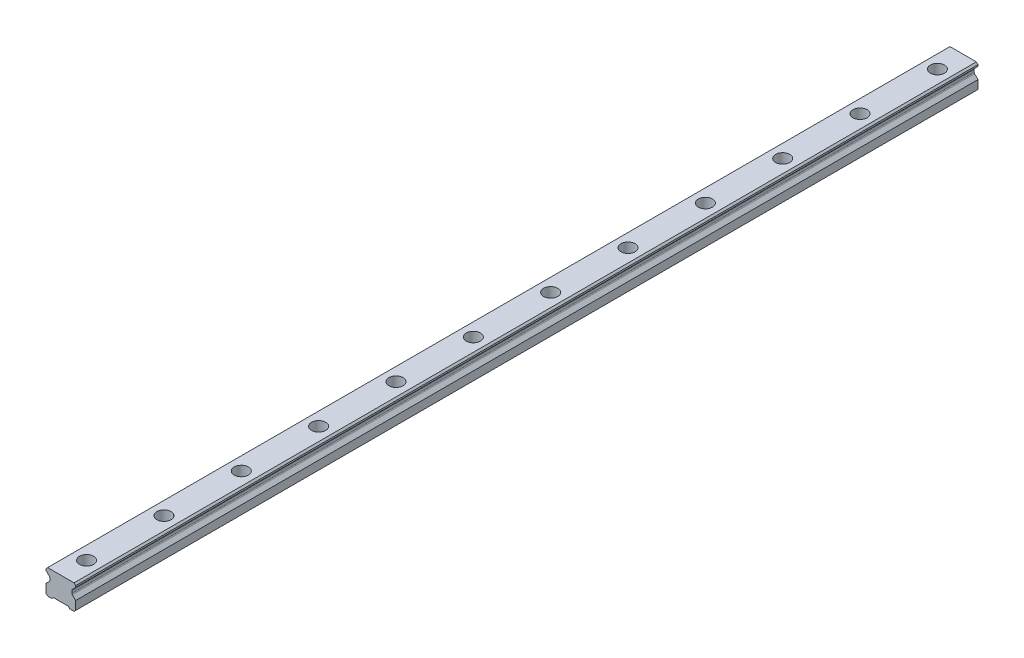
ISO-10303-21;
HEADER;
FILE_DESCRIPTION(('STEP AP214'),'2;1');
FILE_NAME('part.step','',(''),(''),'','','');
FILE_SCHEMA(('AUTOMOTIVE_DESIGN { 1 0 10303 214 1 1 1 1 }'));
ENDSEC;
DATA;
#1=APPLICATION_CONTEXT('core data for automotive mechanical design processes');
#2=APPLICATION_PROTOCOL_DEFINITION('international standard','automotive_design',2000,#1);
#3=PRODUCT_CONTEXT('',#1,'mechanical');
#4=PRODUCT('Part','Part','',(#3));
#5=PRODUCT_RELATED_PRODUCT_CATEGORY('part','',(#4));
#6=PRODUCT_DEFINITION_FORMATION('','',#4);
#7=PRODUCT_DEFINITION_CONTEXT('part definition',#1,'design');
#8=PRODUCT_DEFINITION('design','',#6,#7);
#9=PRODUCT_DEFINITION_SHAPE('','',#8);
#10=(LENGTH_UNIT() NAMED_UNIT(*) SI_UNIT(.MILLI.,.METRE.));
#11=(NAMED_UNIT(*) PLANE_ANGLE_UNIT() SI_UNIT($,.RADIAN.));
#12=(NAMED_UNIT(*) SI_UNIT($,.STERADIAN.) SOLID_ANGLE_UNIT());
#13=UNCERTAINTY_MEASURE_WITH_UNIT(LENGTH_MEASURE(1.E-05),#10,'distance_accuracy_value','');
#14=(GEOMETRIC_REPRESENTATION_CONTEXT(3) GLOBAL_UNCERTAINTY_ASSIGNED_CONTEXT((#13)) GLOBAL_UNIT_ASSIGNED_CONTEXT((#10,
#11,#12)) REPRESENTATION_CONTEXT('',''));
#15=CARTESIAN_POINT('',(0.,0.,0.));
#16=DIRECTION('',(0.,0.,1.));
#17=DIRECTION('',(1.,0.,0.));
#18=AXIS2_PLACEMENT_3D('',#15,#16,#17);
#19=CARTESIAN_POINT('',(0.,10.2,-330.));
#20=DIRECTION('',(0.,1.,0.));
#21=DIRECTION('',(0.,0.,1.));
#22=AXIS2_PLACEMENT_3D('',#19,#20,#21);
#23=PLANE('',#22);
#24=CARTESIAN_POINT('',(0.,10.2,-330.));
#25=DIRECTION('',(0.,1.,0.));
#26=DIRECTION('',(0.,0.,1.));
#27=AXIS2_PLACEMENT_3D('',#24,#25,#26);
#28=CIRCLE('',#27,3.5);
#29=CARTESIAN_POINT('',(0.,10.2,-326.5));
#30=VERTEX_POINT('',#29);
#31=EDGE_CURVE('E439',#30,#30,#28,.T.);
#32=ORIENTED_EDGE('',*,*,#31,.F.);
#33=EDGE_LOOP('',(#32));
#34=FACE_BOUND('',#33,.T.);
#35=CARTESIAN_POINT('',(0.,10.2,-330.));
#36=DIRECTION('',(0.,1.,0.));
#37=DIRECTION('',(0.,0.,1.));
#38=AXIS2_PLACEMENT_3D('',#35,#36,#37);
#39=CIRCLE('',#38,5.5);
#40=CARTESIAN_POINT('',(0.,10.2,-324.5));
#41=VERTEX_POINT('',#40);
#42=EDGE_CURVE('E11',#41,#41,#39,.T.);
#43=ORIENTED_EDGE('',*,*,#42,.T.);
#44=EDGE_LOOP('',(#43));
#45=FACE_BOUND('',#44,.T.);
#46=ADVANCED_FACE('F39',(#34,#45),#23,.T.);
#47=CARTESIAN_POINT('',(0.,10.2,-330.));
#48=DIRECTION('',(0.,1.,0.));
#49=DIRECTION('',(0.,0.,1.));
#50=AXIS2_PLACEMENT_3D('',#47,#48,#49);
#51=CYLINDRICAL_SURFACE('',#50,5.5);
#52=ORIENTED_EDGE('',*,*,#42,.F.);
#53=EDGE_LOOP('',(#52));
#54=FACE_BOUND('',#53,.T.);
#55=CARTESIAN_POINT('',(0.,19.2,-330.));
#56=DIRECTION('',(0.,1.,0.));
#57=DIRECTION('',(0.,0.,1.));
#58=AXIS2_PLACEMENT_3D('',#55,#56,#57);
#59=CIRCLE('',#58,5.5);
#60=CARTESIAN_POINT('',(0.,19.2,-324.5));
#61=VERTEX_POINT('',#60);
#62=EDGE_CURVE('E48',#61,#61,#59,.T.);
#63=ORIENTED_EDGE('',*,*,#62,.T.);
#64=EDGE_LOOP('',(#63));
#65=FACE_BOUND('',#64,.T.);
#66=ADVANCED_FACE('F725',(#54,#65),#51,.F.);
#67=CARTESIAN_POINT('',(0.,10.2,-270.));
#68=DIRECTION('',(0.,1.,0.));
#69=DIRECTION('',(0.,0.,1.));
#70=AXIS2_PLACEMENT_3D('',#67,#68,#69);
#71=PLANE('',#70);
#72=CARTESIAN_POINT('',(0.,10.2,-270.));
#73=DIRECTION('',(0.,1.,0.));
#74=DIRECTION('',(0.,0.,1.));
#75=AXIS2_PLACEMENT_3D('',#72,#73,#74);
#76=CIRCLE('',#75,3.5);
#77=CARTESIAN_POINT('',(0.,10.2,-266.5));
#78=VERTEX_POINT('',#77);
#79=EDGE_CURVE('E444',#78,#78,#76,.T.);
#80=ORIENTED_EDGE('',*,*,#79,.F.);
#81=EDGE_LOOP('',(#80));
#82=FACE_BOUND('',#81,.T.);
#83=CARTESIAN_POINT('',(0.,10.2,-270.));
#84=DIRECTION('',(0.,1.,0.));
#85=DIRECTION('',(0.,0.,1.));
#86=AXIS2_PLACEMENT_3D('',#83,#84,#85);
#87=CIRCLE('',#86,5.5);
#88=CARTESIAN_POINT('',(0.,10.2,-264.5));
#89=VERTEX_POINT('',#88);
#90=EDGE_CURVE('E423',#89,#89,#87,.T.);
#91=ORIENTED_EDGE('',*,*,#90,.T.);
#92=EDGE_LOOP('',(#91));
#93=FACE_BOUND('',#92,.T.);
#94=ADVANCED_FACE('F730',(#82,#93),#71,.T.);
#95=CARTESIAN_POINT('',(0.,10.2,-270.));
#96=DIRECTION('',(0.,1.,0.));
#97=DIRECTION('',(0.,0.,1.));
#98=AXIS2_PLACEMENT_3D('',#95,#96,#97);
#99=CYLINDRICAL_SURFACE('',#98,5.5);
#100=ORIENTED_EDGE('',*,*,#90,.F.);
#101=EDGE_LOOP('',(#100));
#102=FACE_BOUND('',#101,.T.);
#103=CARTESIAN_POINT('',(0.,19.2,-270.));
#104=DIRECTION('',(0.,1.,0.));
#105=DIRECTION('',(0.,0.,1.));
#106=AXIS2_PLACEMENT_3D('',#103,#104,#105);
#107=CIRCLE('',#106,5.5);
#108=CARTESIAN_POINT('',(0.,19.2,-264.5));
#109=VERTEX_POINT('',#108);
#110=EDGE_CURVE('E419',#109,#109,#107,.T.);
#111=ORIENTED_EDGE('',*,*,#110,.T.);
#112=EDGE_LOOP('',(#111));
#113=FACE_BOUND('',#112,.T.);
#114=ADVANCED_FACE('F838',(#102,#113),#99,.F.);
#115=CARTESIAN_POINT('',(0.,10.2,-210.));
#116=DIRECTION('',(0.,1.,0.));
#117=DIRECTION('',(0.,0.,1.));
#118=AXIS2_PLACEMENT_3D('',#115,#116,#117);
#119=PLANE('',#118);
#120=CARTESIAN_POINT('',(0.,10.2,-210.));
#121=DIRECTION('',(0.,1.,0.));
#122=DIRECTION('',(0.,0.,1.));
#123=AXIS2_PLACEMENT_3D('',#120,#121,#122);
#124=CIRCLE('',#123,3.5);
#125=CARTESIAN_POINT('',(0.,10.2,-206.5));
#126=VERTEX_POINT('',#125);
#127=EDGE_CURVE('E449',#126,#126,#124,.T.);
#128=ORIENTED_EDGE('',*,*,#127,.F.);
#129=EDGE_LOOP('',(#128));
#130=FACE_BOUND('',#129,.T.);
#131=CARTESIAN_POINT('',(0.,10.2,-210.));
#132=DIRECTION('',(0.,1.,0.));
#133=DIRECTION('',(0.,0.,1.));
#134=AXIS2_PLACEMENT_3D('',#131,#132,#133);
#135=CIRCLE('',#134,5.5);
#136=CARTESIAN_POINT('',(0.,10.2,-204.5));
#137=VERTEX_POINT('',#136);
#138=EDGE_CURVE('E415',#137,#137,#135,.T.);
#139=ORIENTED_EDGE('',*,*,#138,.T.);
#140=EDGE_LOOP('',(#139));
#141=FACE_BOUND('',#140,.T.);
#142=ADVANCED_FACE('F834',(#130,#141),#119,.T.);
#143=CARTESIAN_POINT('',(0.,10.2,-210.));
#144=DIRECTION('',(0.,1.,0.));
#145=DIRECTION('',(0.,0.,1.));
#146=AXIS2_PLACEMENT_3D('',#143,#144,#145);
#147=CYLINDRICAL_SURFACE('',#146,5.5);
#148=ORIENTED_EDGE('',*,*,#138,.F.);
#149=EDGE_LOOP('',(#148));
#150=FACE_BOUND('',#149,.T.);
#151=CARTESIAN_POINT('',(0.,19.2,-210.));
#152=DIRECTION('',(0.,1.,0.));
#153=DIRECTION('',(0.,0.,1.));
#154=AXIS2_PLACEMENT_3D('',#151,#152,#153);
#155=CIRCLE('',#154,5.5);
#156=CARTESIAN_POINT('',(0.,19.2,-204.5));
#157=VERTEX_POINT('',#156);
#158=EDGE_CURVE('E411',#157,#157,#155,.T.);
#159=ORIENTED_EDGE('',*,*,#158,.T.);
#160=EDGE_LOOP('',(#159));
#161=FACE_BOUND('',#160,.T.);
#162=ADVANCED_FACE('F830',(#150,#161),#147,.F.);
#163=CARTESIAN_POINT('',(0.,10.2,-150.));
#164=DIRECTION('',(0.,1.,0.));
#165=DIRECTION('',(0.,0.,1.));
#166=AXIS2_PLACEMENT_3D('',#163,#164,#165);
#167=PLANE('',#166);
#168=CARTESIAN_POINT('',(0.,10.2,-150.));
#169=DIRECTION('',(0.,1.,0.));
#170=DIRECTION('',(0.,0.,1.));
#171=AXIS2_PLACEMENT_3D('',#168,#169,#170);
#172=CIRCLE('',#171,3.5);
#173=CARTESIAN_POINT('',(0.,10.2,-146.5));
#174=VERTEX_POINT('',#173);
#175=EDGE_CURVE('E454',#174,#174,#172,.T.);
#176=ORIENTED_EDGE('',*,*,#175,.F.);
#177=EDGE_LOOP('',(#176));
#178=FACE_BOUND('',#177,.T.);
#179=CARTESIAN_POINT('',(0.,10.2,-150.));
#180=DIRECTION('',(0.,1.,0.));
#181=DIRECTION('',(0.,0.,1.));
#182=AXIS2_PLACEMENT_3D('',#179,#180,#181);
#183=CIRCLE('',#182,5.5);
#184=CARTESIAN_POINT('',(0.,10.2,-144.5));
#185=VERTEX_POINT('',#184);
#186=EDGE_CURVE('E407',#185,#185,#183,.T.);
#187=ORIENTED_EDGE('',*,*,#186,.T.);
#188=EDGE_LOOP('',(#187));
#189=FACE_BOUND('',#188,.T.);
#190=ADVANCED_FACE('F826',(#178,#189),#167,.T.);
#191=CARTESIAN_POINT('',(0.,10.2,-150.));
#192=DIRECTION('',(0.,1.,0.));
#193=DIRECTION('',(0.,0.,1.));
#194=AXIS2_PLACEMENT_3D('',#191,#192,#193);
#195=CYLINDRICAL_SURFACE('',#194,5.5);
#196=ORIENTED_EDGE('',*,*,#186,.F.);
#197=EDGE_LOOP('',(#196));
#198=FACE_BOUND('',#197,.T.);
#199=CARTESIAN_POINT('',(0.,19.2,-150.));
#200=DIRECTION('',(0.,1.,0.));
#201=DIRECTION('',(0.,0.,1.));
#202=AXIS2_PLACEMENT_3D('',#199,#200,#201);
#203=CIRCLE('',#202,5.5);
#204=CARTESIAN_POINT('',(0.,19.2,-144.5));
#205=VERTEX_POINT('',#204);
#206=EDGE_CURVE('E403',#205,#205,#203,.T.);
#207=ORIENTED_EDGE('',*,*,#206,.T.);
#208=EDGE_LOOP('',(#207));
#209=FACE_BOUND('',#208,.T.);
#210=ADVANCED_FACE('F822',(#198,#209),#195,.F.);
#211=CARTESIAN_POINT('',(0.,10.2,-90.));
#212=DIRECTION('',(0.,1.,0.));
#213=DIRECTION('',(0.,0.,1.));
#214=AXIS2_PLACEMENT_3D('',#211,#212,#213);
#215=PLANE('',#214);
#216=CARTESIAN_POINT('',(0.,10.2,-90.));
#217=DIRECTION('',(0.,1.,0.));
#218=DIRECTION('',(0.,0.,1.));
#219=AXIS2_PLACEMENT_3D('',#216,#217,#218);
#220=CIRCLE('',#219,3.5);
#221=CARTESIAN_POINT('',(0.,10.2,-86.5));
#222=VERTEX_POINT('',#221);
#223=EDGE_CURVE('E459',#222,#222,#220,.T.);
#224=ORIENTED_EDGE('',*,*,#223,.F.);
#225=EDGE_LOOP('',(#224));
#226=FACE_BOUND('',#225,.T.);
#227=CARTESIAN_POINT('',(0.,10.2,-90.));
#228=DIRECTION('',(0.,1.,0.));
#229=DIRECTION('',(0.,0.,1.));
#230=AXIS2_PLACEMENT_3D('',#227,#228,#229);
#231=CIRCLE('',#230,5.5);
#232=CARTESIAN_POINT('',(0.,10.2,-84.5));
#233=VERTEX_POINT('',#232);
#234=EDGE_CURVE('E399',#233,#233,#231,.T.);
#235=ORIENTED_EDGE('',*,*,#234,.T.);
#236=EDGE_LOOP('',(#235));
#237=FACE_BOUND('',#236,.T.);
#238=ADVANCED_FACE('F818',(#226,#237),#215,.T.);
#239=CARTESIAN_POINT('',(0.,10.2,-90.));
#240=DIRECTION('',(0.,1.,0.));
#241=DIRECTION('',(0.,0.,1.));
#242=AXIS2_PLACEMENT_3D('',#239,#240,#241);
#243=CYLINDRICAL_SURFACE('',#242,5.5);
#244=ORIENTED_EDGE('',*,*,#234,.F.);
#245=EDGE_LOOP('',(#244));
#246=FACE_BOUND('',#245,.T.);
#247=CARTESIAN_POINT('',(0.,19.2,-90.));
#248=DIRECTION('',(0.,1.,0.));
#249=DIRECTION('',(0.,0.,1.));
#250=AXIS2_PLACEMENT_3D('',#247,#248,#249);
#251=CIRCLE('',#250,5.5);
#252=CARTESIAN_POINT('',(0.,19.2,-84.5));
#253=VERTEX_POINT('',#252);
#254=EDGE_CURVE('E395',#253,#253,#251,.T.);
#255=ORIENTED_EDGE('',*,*,#254,.T.);
#256=EDGE_LOOP('',(#255));
#257=FACE_BOUND('',#256,.T.);
#258=ADVANCED_FACE('F814',(#246,#257),#243,.F.);
#259=CARTESIAN_POINT('',(0.,10.2,-30.));
#260=DIRECTION('',(0.,1.,0.));
#261=DIRECTION('',(0.,0.,1.));
#262=AXIS2_PLACEMENT_3D('',#259,#260,#261);
#263=PLANE('',#262);
#264=CARTESIAN_POINT('',(0.,10.2,-30.));
#265=DIRECTION('',(0.,1.,0.));
#266=DIRECTION('',(0.,0.,1.));
#267=AXIS2_PLACEMENT_3D('',#264,#265,#266);
#268=CIRCLE('',#267,3.5);
#269=CARTESIAN_POINT('',(0.,10.2,-26.5));
#270=VERTEX_POINT('',#269);
#271=EDGE_CURVE('E464',#270,#270,#268,.T.);
#272=ORIENTED_EDGE('',*,*,#271,.F.);
#273=EDGE_LOOP('',(#272));
#274=FACE_BOUND('',#273,.T.);
#275=CARTESIAN_POINT('',(0.,10.2,-30.));
#276=DIRECTION('',(0.,1.,0.));
#277=DIRECTION('',(0.,0.,1.));
#278=AXIS2_PLACEMENT_3D('',#275,#276,#277);
#279=CIRCLE('',#278,5.5);
#280=CARTESIAN_POINT('',(0.,10.2,-24.5));
#281=VERTEX_POINT('',#280);
#282=EDGE_CURVE('E391',#281,#281,#279,.T.);
#283=ORIENTED_EDGE('',*,*,#282,.T.);
#284=EDGE_LOOP('',(#283));
#285=FACE_BOUND('',#284,.T.);
#286=ADVANCED_FACE('F810',(#274,#285),#263,.T.);
#287=CARTESIAN_POINT('',(0.,10.2,-30.));
#288=DIRECTION('',(0.,1.,0.));
#289=DIRECTION('',(0.,0.,1.));
#290=AXIS2_PLACEMENT_3D('',#287,#288,#289);
#291=CYLINDRICAL_SURFACE('',#290,5.5);
#292=ORIENTED_EDGE('',*,*,#282,.F.);
#293=EDGE_LOOP('',(#292));
#294=FACE_BOUND('',#293,.T.);
#295=CARTESIAN_POINT('',(0.,19.2,-30.));
#296=DIRECTION('',(0.,1.,0.));
#297=DIRECTION('',(0.,0.,1.));
#298=AXIS2_PLACEMENT_3D('',#295,#296,#297);
#299=CIRCLE('',#298,5.5);
#300=CARTESIAN_POINT('',(0.,19.2,-24.5));
#301=VERTEX_POINT('',#300);
#302=EDGE_CURVE('E387',#301,#301,#299,.T.);
#303=ORIENTED_EDGE('',*,*,#302,.T.);
#304=EDGE_LOOP('',(#303));
#305=FACE_BOUND('',#304,.T.);
#306=ADVANCED_FACE('F806',(#294,#305),#291,.F.);
#307=CARTESIAN_POINT('',(0.,10.2,30.));
#308=DIRECTION('',(0.,1.,0.));
#309=DIRECTION('',(0.,0.,1.));
#310=AXIS2_PLACEMENT_3D('',#307,#308,#309);
#311=PLANE('',#310);
#312=CARTESIAN_POINT('',(0.,10.2,30.));
#313=DIRECTION('',(0.,1.,0.));
#314=DIRECTION('',(0.,0.,1.));
#315=AXIS2_PLACEMENT_3D('',#312,#313,#314);
#316=CIRCLE('',#315,3.5);
#317=CARTESIAN_POINT('',(0.,10.2,33.5));
#318=VERTEX_POINT('',#317);
#319=EDGE_CURVE('E469',#318,#318,#316,.T.);
#320=ORIENTED_EDGE('',*,*,#319,.F.);
#321=EDGE_LOOP('',(#320));
#322=FACE_BOUND('',#321,.T.);
#323=CARTESIAN_POINT('',(0.,10.2,30.));
#324=DIRECTION('',(0.,1.,0.));
#325=DIRECTION('',(0.,0.,1.));
#326=AXIS2_PLACEMENT_3D('',#323,#324,#325);
#327=CIRCLE('',#326,5.5);
#328=CARTESIAN_POINT('',(0.,10.2,35.5));
#329=VERTEX_POINT('',#328);
#330=EDGE_CURVE('E383',#329,#329,#327,.T.);
#331=ORIENTED_EDGE('',*,*,#330,.T.);
#332=EDGE_LOOP('',(#331));
#333=FACE_BOUND('',#332,.T.);
#334=ADVANCED_FACE('F802',(#322,#333),#311,.T.);
#335=CARTESIAN_POINT('',(0.,10.2,30.));
#336=DIRECTION('',(0.,1.,0.));
#337=DIRECTION('',(0.,0.,1.));
#338=AXIS2_PLACEMENT_3D('',#335,#336,#337);
#339=CYLINDRICAL_SURFACE('',#338,5.5);
#340=ORIENTED_EDGE('',*,*,#330,.F.);
#341=EDGE_LOOP('',(#340));
#342=FACE_BOUND('',#341,.T.);
#343=CARTESIAN_POINT('',(0.,19.2,30.));
#344=DIRECTION('',(0.,1.,0.));
#345=DIRECTION('',(0.,0.,1.));
#346=AXIS2_PLACEMENT_3D('',#343,#344,#345);
#347=CIRCLE('',#346,5.5);
#348=CARTESIAN_POINT('',(0.,19.2,35.5));
#349=VERTEX_POINT('',#348);
#350=EDGE_CURVE('E379',#349,#349,#347,.T.);
#351=ORIENTED_EDGE('',*,*,#350,.T.);
#352=EDGE_LOOP('',(#351));
#353=FACE_BOUND('',#352,.T.);
#354=ADVANCED_FACE('F798',(#342,#353),#339,.F.);
#355=CARTESIAN_POINT('',(0.,10.2,90.));
#356=DIRECTION('',(0.,1.,0.));
#357=DIRECTION('',(0.,0.,1.));
#358=AXIS2_PLACEMENT_3D('',#355,#356,#357);
#359=PLANE('',#358);
#360=CARTESIAN_POINT('',(0.,10.2,90.));
#361=DIRECTION('',(0.,1.,0.));
#362=DIRECTION('',(0.,0.,1.));
#363=AXIS2_PLACEMENT_3D('',#360,#361,#362);
#364=CIRCLE('',#363,3.5);
#365=CARTESIAN_POINT('',(0.,10.2,93.5));
#366=VERTEX_POINT('',#365);
#367=EDGE_CURVE('E473',#366,#366,#364,.T.);
#368=ORIENTED_EDGE('',*,*,#367,.F.);
#369=EDGE_LOOP('',(#368));
#370=FACE_BOUND('',#369,.T.);
#371=CARTESIAN_POINT('',(0.,10.2,90.));
#372=DIRECTION('',(0.,1.,0.));
#373=DIRECTION('',(0.,0.,1.));
#374=AXIS2_PLACEMENT_3D('',#371,#372,#373);
#375=CIRCLE('',#374,5.5);
#376=CARTESIAN_POINT('',(0.,10.2,95.5));
#377=VERTEX_POINT('',#376);
#378=EDGE_CURVE('E375',#377,#377,#375,.T.);
#379=ORIENTED_EDGE('',*,*,#378,.T.);
#380=EDGE_LOOP('',(#379));
#381=FACE_BOUND('',#380,.T.);
#382=ADVANCED_FACE('F794',(#370,#381),#359,.T.);
#383=CARTESIAN_POINT('',(0.,10.2,90.));
#384=DIRECTION('',(0.,1.,0.));
#385=DIRECTION('',(0.,0.,1.));
#386=AXIS2_PLACEMENT_3D('',#383,#384,#385);
#387=CYLINDRICAL_SURFACE('',#386,5.5);
#388=ORIENTED_EDGE('',*,*,#378,.F.);
#389=EDGE_LOOP('',(#388));
#390=FACE_BOUND('',#389,.T.);
#391=CARTESIAN_POINT('',(0.,19.2,90.));
#392=DIRECTION('',(0.,1.,0.));
#393=DIRECTION('',(0.,0.,1.));
#394=AXIS2_PLACEMENT_3D('',#391,#392,#393);
#395=CIRCLE('',#394,5.5);
#396=CARTESIAN_POINT('',(0.,19.2,95.5));
#397=VERTEX_POINT('',#396);
#398=EDGE_CURVE('E371',#397,#397,#395,.T.);
#399=ORIENTED_EDGE('',*,*,#398,.T.);
#400=EDGE_LOOP('',(#399));
#401=FACE_BOUND('',#400,.T.);
#402=ADVANCED_FACE('F790',(#390,#401),#387,.F.);
#403=CARTESIAN_POINT('',(0.,10.2,150.));
#404=DIRECTION('',(0.,1.,0.));
#405=DIRECTION('',(0.,0.,1.));
#406=AXIS2_PLACEMENT_3D('',#403,#404,#405);
#407=PLANE('',#406);
#408=CARTESIAN_POINT('',(0.,10.2,150.));
#409=DIRECTION('',(0.,1.,0.));
#410=DIRECTION('',(0.,0.,1.));
#411=AXIS2_PLACEMENT_3D('',#408,#409,#410);
#412=CIRCLE('',#411,3.5);
#413=CARTESIAN_POINT('',(0.,10.2,153.5));
#414=VERTEX_POINT('',#413);
#415=EDGE_CURVE('E477',#414,#414,#412,.T.);
#416=ORIENTED_EDGE('',*,*,#415,.F.);
#417=EDGE_LOOP('',(#416));
#418=FACE_BOUND('',#417,.T.);
#419=CARTESIAN_POINT('',(0.,10.2,150.));
#420=DIRECTION('',(0.,1.,0.));
#421=DIRECTION('',(0.,0.,1.));
#422=AXIS2_PLACEMENT_3D('',#419,#420,#421);
#423=CIRCLE('',#422,5.5);
#424=CARTESIAN_POINT('',(0.,10.2,155.5));
#425=VERTEX_POINT('',#424);
#426=EDGE_CURVE('E367',#425,#425,#423,.T.);
#427=ORIENTED_EDGE('',*,*,#426,.T.);
#428=EDGE_LOOP('',(#427));
#429=FACE_BOUND('',#428,.T.);
#430=ADVANCED_FACE('F786',(#418,#429),#407,.T.);
#431=CARTESIAN_POINT('',(0.,10.2,150.));
#432=DIRECTION('',(0.,1.,0.));
#433=DIRECTION('',(0.,0.,1.));
#434=AXIS2_PLACEMENT_3D('',#431,#432,#433);
#435=CYLINDRICAL_SURFACE('',#434,5.5);
#436=ORIENTED_EDGE('',*,*,#426,.F.);
#437=EDGE_LOOP('',(#436));
#438=FACE_BOUND('',#437,.T.);
#439=CARTESIAN_POINT('',(0.,19.2,150.));
#440=DIRECTION('',(0.,1.,0.));
#441=DIRECTION('',(0.,0.,1.));
#442=AXIS2_PLACEMENT_3D('',#439,#440,#441);
#443=CIRCLE('',#442,5.5);
#444=CARTESIAN_POINT('',(0.,19.2,155.5));
#445=VERTEX_POINT('',#444);
#446=EDGE_CURVE('E363',#445,#445,#443,.T.);
#447=ORIENTED_EDGE('',*,*,#446,.T.);
#448=EDGE_LOOP('',(#447));
#449=FACE_BOUND('',#448,.T.);
#450=ADVANCED_FACE('F782',(#438,#449),#435,.F.);
#451=CARTESIAN_POINT('',(0.,10.2,210.));
#452=DIRECTION('',(0.,1.,0.));
#453=DIRECTION('',(0.,0.,1.));
#454=AXIS2_PLACEMENT_3D('',#451,#452,#453);
#455=PLANE('',#454);
#456=CARTESIAN_POINT('',(0.,10.2,210.));
#457=DIRECTION('',(0.,1.,0.));
#458=DIRECTION('',(0.,0.,1.));
#459=AXIS2_PLACEMENT_3D('',#456,#457,#458);
#460=CIRCLE('',#459,3.5);
#461=CARTESIAN_POINT('',(0.,10.2,213.5));
#462=VERTEX_POINT('',#461);
#463=EDGE_CURVE('E492',#462,#462,#460,.T.);
#464=ORIENTED_EDGE('',*,*,#463,.F.);
#465=EDGE_LOOP('',(#464));
#466=FACE_BOUND('',#465,.T.);
#467=CARTESIAN_POINT('',(0.,10.2,210.));
#468=DIRECTION('',(0.,1.,0.));
#469=DIRECTION('',(0.,0.,1.));
#470=AXIS2_PLACEMENT_3D('',#467,#468,#469);
#471=CIRCLE('',#470,5.5);
#472=CARTESIAN_POINT('',(0.,10.2,215.5));
#473=VERTEX_POINT('',#472);
#474=EDGE_CURVE('E359',#473,#473,#471,.T.);
#475=ORIENTED_EDGE('',*,*,#474,.T.);
#476=EDGE_LOOP('',(#475));
#477=FACE_BOUND('',#476,.T.);
#478=ADVANCED_FACE('F778',(#466,#477),#455,.T.);
#479=CARTESIAN_POINT('',(0.,10.2,210.));
#480=DIRECTION('',(0.,1.,0.));
#481=DIRECTION('',(0.,0.,1.));
#482=AXIS2_PLACEMENT_3D('',#479,#480,#481);
#483=CYLINDRICAL_SURFACE('',#482,5.5);
#484=ORIENTED_EDGE('',*,*,#474,.F.);
#485=EDGE_LOOP('',(#484));
#486=FACE_BOUND('',#485,.T.);
#487=CARTESIAN_POINT('',(0.,19.2,210.));
#488=DIRECTION('',(0.,1.,0.));
#489=DIRECTION('',(0.,0.,1.));
#490=AXIS2_PLACEMENT_3D('',#487,#488,#489);
#491=CIRCLE('',#490,5.5);
#492=CARTESIAN_POINT('',(0.,19.2,215.5));
#493=VERTEX_POINT('',#492);
#494=EDGE_CURVE('E355',#493,#493,#491,.T.);
#495=ORIENTED_EDGE('',*,*,#494,.T.);
#496=EDGE_LOOP('',(#495));
#497=FACE_BOUND('',#496,.T.);
#498=ADVANCED_FACE('F775',(#486,#497),#483,.F.);
#499=CARTESIAN_POINT('',(11.5,0.,350.));
#500=DIRECTION('',(0.,1.,0.));
#501=DIRECTION('',(-1.,0.,0.));
#502=AXIS2_PLACEMENT_3D('',#499,#500,#501);
#503=PLANE('',#502);
#504=DIRECTION('',(1.,0.,0.));
#505=VECTOR('',#504,1.);
#506=CARTESIAN_POINT('',(11.5,0.,-350.));
#507=LINE('',#506,#505);
#508=CARTESIAN_POINT('',(-10.25,0.,-350.));
#509=VERTEX_POINT('',#508);
#510=CARTESIAN_POINT('',(-7.,0.,-350.));
#511=VERTEX_POINT('',#510);
#512=EDGE_CURVE('E229',#509,#511,#507,.T.);
#513=ORIENTED_EDGE('',*,*,#512,.T.);
#514=DIRECTION('',(0.,0.,1.));
#515=VECTOR('',#514,1.);
#516=CARTESIAN_POINT('',(-7.,0.,-350.));
#517=LINE('',#516,#515);
#518=CARTESIAN_POINT('',(-7.,0.,350.));
#519=VERTEX_POINT('',#518);
#520=EDGE_CURVE('E532',#511,#519,#517,.T.);
#521=ORIENTED_EDGE('',*,*,#520,.T.);
#522=DIRECTION('',(1.,0.,0.));
#523=VECTOR('',#522,1.);
#524=CARTESIAN_POINT('',(11.5,0.,350.));
#525=LINE('',#524,#523);
#526=CARTESIAN_POINT('',(-10.25,0.,350.));
#527=VERTEX_POINT('',#526);
#528=EDGE_CURVE('E602',#527,#519,#525,.T.);
#529=ORIENTED_EDGE('',*,*,#528,.F.);
#530=DIRECTION('',(0.,0.,-1.));
#531=VECTOR('',#530,1.);
#532=CARTESIAN_POINT('',(-10.25,0.,350.));
#533=LINE('',#532,#531);
#534=EDGE_CURVE('E290',#527,#509,#533,.T.);
#535=ORIENTED_EDGE('',*,*,#534,.T.);
#536=EDGE_LOOP('',(#513,#521,#529,#535));
#537=FACE_BOUND('',#536,.T.);
#538=ADVANCED_FACE('F706',(#537),#503,.F.);
#539=CARTESIAN_POINT('',(-11.5,19.2,350.));
#540=DIRECTION('',(1.,0.,0.));
#541=DIRECTION('',(0.,1.,0.));
#542=AXIS2_PLACEMENT_3D('',#539,#540,#541);
#543=PLANE('',#542);
#544=DIRECTION('',(0.,-1.,0.));
#545=VECTOR('',#544,1.);
#546=CARTESIAN_POINT('',(-11.5,19.2,350.));
#547=LINE('',#546,#545);
#548=CARTESIAN_POINT('',(-11.5,17.9500000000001,350.));
#549=VERTEX_POINT('',#548);
#550=CARTESIAN_POINT('',(-11.5,16.7,350.));
#551=VERTEX_POINT('',#550);
#552=EDGE_CURVE('E598',#549,#551,#547,.T.);
#553=ORIENTED_EDGE('',*,*,#552,.F.);
#554=DIRECTION('',(0.,0.,-1.));
#555=VECTOR('',#554,1.);
#556=CARTESIAN_POINT('',(-11.5,17.9500000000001,350.));
#557=LINE('',#556,#555);
#558=CARTESIAN_POINT('',(-11.5,17.9500000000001,-350.));
#559=VERTEX_POINT('',#558);
#560=EDGE_CURVE('E252',#549,#559,#557,.T.);
#561=ORIENTED_EDGE('',*,*,#560,.T.);
#562=DIRECTION('',(0.,-1.,0.));
#563=VECTOR('',#562,1.);
#564=CARTESIAN_POINT('',(-11.5,19.2,-350.));
#565=LINE('',#564,#563);
#566=CARTESIAN_POINT('',(-11.5,16.7,-350.));
#567=VERTEX_POINT('',#566);
#568=EDGE_CURVE('E230',#559,#567,#565,.T.);
#569=ORIENTED_EDGE('',*,*,#568,.T.);
#570=DIRECTION('',(0.,0.,1.));
#571=VECTOR('',#570,1.);
#572=CARTESIAN_POINT('',(-11.5,16.7,-350.));
#573=LINE('',#572,#571);
#574=EDGE_CURVE('E553',#567,#551,#573,.T.);
#575=ORIENTED_EDGE('',*,*,#574,.T.);
#576=EDGE_LOOP('',(#553,#561,#569,#575));
#577=FACE_BOUND('',#576,.T.);
#578=ADVANCED_FACE('F626',(#577),#543,.F.);
#579=CARTESIAN_POINT('',(11.5,19.2,350.));
#580=DIRECTION('',(-1.,0.,0.));
#581=DIRECTION('',(0.,0.,1.));
#582=AXIS2_PLACEMENT_3D('',#579,#580,#581);
#583=PLANE('',#582);
#584=DIRECTION('',(0.,1.,0.));
#585=VECTOR('',#584,1.);
#586=CARTESIAN_POINT('',(11.5,19.2,350.));
#587=LINE('',#586,#585);
#588=CARTESIAN_POINT('',(11.5,1.24999999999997,350.));
#589=VERTEX_POINT('',#588);
#590=CARTESIAN_POINT('',(11.5,7.95,350.));
#591=VERTEX_POINT('',#590);
#592=EDGE_CURVE('E607',#589,#591,#587,.T.);
#593=ORIENTED_EDGE('',*,*,#592,.F.);
#594=DIRECTION('',(0.,0.,-1.));
#595=VECTOR('',#594,1.);
#596=CARTESIAN_POINT('',(11.5,1.24999999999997,350.));
#597=LINE('',#596,#595);
#598=CARTESIAN_POINT('',(11.5,1.24999999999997,-350.));
#599=VERTEX_POINT('',#598);
#600=EDGE_CURVE('E297',#589,#599,#597,.T.);
#601=ORIENTED_EDGE('',*,*,#600,.T.);
#602=DIRECTION('',(0.,1.,0.));
#603=VECTOR('',#602,1.);
#604=CARTESIAN_POINT('',(11.5,19.2,-350.));
#605=LINE('',#604,#603);
#606=CARTESIAN_POINT('',(11.5,7.95,-350.));
#607=VERTEX_POINT('',#606);
#608=EDGE_CURVE('E243',#599,#607,#605,.T.);
#609=ORIENTED_EDGE('',*,*,#608,.T.);
#610=DIRECTION('',(0.,0.,1.));
#611=VECTOR('',#610,1.);
#612=CARTESIAN_POINT('',(11.5,7.95,-350.));
#613=LINE('',#612,#611);
#614=EDGE_CURVE('E583',#607,#591,#613,.T.);
#615=ORIENTED_EDGE('',*,*,#614,.T.);
#616=EDGE_LOOP('',(#593,#601,#609,#615));
#617=FACE_BOUND('',#616,.T.);
#618=ADVANCED_FACE('F668',(#617),#583,.F.);
#619=CARTESIAN_POINT('',(-11.5,7.95,-350.));
#620=VERTEX_POINT('',#619);
#621=CARTESIAN_POINT('',(-11.5,1.24999999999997,-350.));
#622=VERTEX_POINT('',#621);
#623=EDGE_CURVE('E239',#620,#622,#565,.T.);
#624=ORIENTED_EDGE('',*,*,#623,.T.);
#625=DIRECTION('',(0.,0.,1.));
#626=VECTOR('',#625,1.);
#627=CARTESIAN_POINT('',(-11.5,1.24999999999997,350.));
#628=LINE('',#627,#626);
#629=CARTESIAN_POINT('',(-11.5,1.24999999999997,350.));
#630=VERTEX_POINT('',#629);
#631=EDGE_CURVE('E294',#622,#630,#628,.T.);
#632=ORIENTED_EDGE('',*,*,#631,.T.);
#633=CARTESIAN_POINT('',(-11.5,7.95,350.));
#634=VERTEX_POINT('',#633);
#635=EDGE_CURVE('E251',#634,#630,#547,.T.);
#636=ORIENTED_EDGE('',*,*,#635,.F.);
#637=DIRECTION('',(0.,0.,1.));
#638=VECTOR('',#637,1.);
#639=CARTESIAN_POINT('',(-11.5,7.95,-350.));
#640=LINE('',#639,#638);
#641=EDGE_CURVE('E565',#620,#634,#640,.T.);
#642=ORIENTED_EDGE('',*,*,#641,.F.);
#643=EDGE_LOOP('',(#624,#632,#636,#642));
#644=FACE_BOUND('',#643,.T.);
#645=ADVANCED_FACE('F654',(#644),#543,.F.);
#646=CARTESIAN_POINT('',(7.,0.,350.));
#647=VERTEX_POINT('',#646);
#648=CARTESIAN_POINT('',(10.25,0.,350.));
#649=VERTEX_POINT('',#648);
#650=EDGE_CURVE('E219',#647,#649,#525,.T.);
#651=ORIENTED_EDGE('',*,*,#650,.F.);
#652=DIRECTION('',(0.,0.,1.));
#653=VECTOR('',#652,1.);
#654=CARTESIAN_POINT('',(7.,0.,-350.));
#655=LINE('',#654,#653);
#656=CARTESIAN_POINT('',(7.,0.,-350.));
#657=VERTEX_POINT('',#656);
#658=EDGE_CURVE('E206',#657,#647,#655,.T.);
#659=ORIENTED_EDGE('',*,*,#658,.F.);
#660=CARTESIAN_POINT('',(10.25,0.,-350.));
#661=VERTEX_POINT('',#660);
#662=EDGE_CURVE('E217',#657,#661,#507,.T.);
#663=ORIENTED_EDGE('',*,*,#662,.T.);
#664=DIRECTION('',(0.,0.,1.));
#665=VECTOR('',#664,1.);
#666=CARTESIAN_POINT('',(10.25,0.,350.));
#667=LINE('',#666,#665);
#668=EDGE_CURVE('E287',#661,#649,#667,.T.);
#669=ORIENTED_EDGE('',*,*,#668,.T.);
#670=EDGE_LOOP('',(#651,#659,#663,#669));
#671=FACE_BOUND('',#670,.T.);
#672=ADVANCED_FACE('F215',(#671),#503,.F.);
#673=CARTESIAN_POINT('',(11.5,16.7,-350.));
#674=VERTEX_POINT('',#673);
#675=CARTESIAN_POINT('',(11.5,17.95,-350.));
#676=VERTEX_POINT('',#675);
#677=EDGE_CURVE('E236',#674,#676,#605,.T.);
#678=ORIENTED_EDGE('',*,*,#677,.T.);
#679=DIRECTION('',(0.,0.,1.));
#680=VECTOR('',#679,1.);
#681=CARTESIAN_POINT('',(11.5,17.95,350.));
#682=LINE('',#681,#680);
#683=CARTESIAN_POINT('',(11.5,17.95,350.));
#684=VERTEX_POINT('',#683);
#685=EDGE_CURVE('E301',#676,#684,#682,.T.);
#686=ORIENTED_EDGE('',*,*,#685,.T.);
#687=CARTESIAN_POINT('',(11.5,16.7,350.));
#688=VERTEX_POINT('',#687);
#689=EDGE_CURVE('E606',#688,#684,#587,.T.);
#690=ORIENTED_EDGE('',*,*,#689,.F.);
#691=DIRECTION('',(0.,0.,1.));
#692=VECTOR('',#691,1.);
#693=CARTESIAN_POINT('',(11.5,16.7,-350.));
#694=LINE('',#693,#692);
#695=EDGE_CURVE('E558',#674,#688,#694,.T.);
#696=ORIENTED_EDGE('',*,*,#695,.F.);
#697=EDGE_LOOP('',(#678,#686,#690,#696));
#698=FACE_BOUND('',#697,.T.);
#699=ADVANCED_FACE('F696',(#698),#583,.F.);
#700=CARTESIAN_POINT('',(11.5,19.2,350.));
#701=DIRECTION('',(0.,-1.,0.));
#702=DIRECTION('',(0.,0.,-1.));
#703=AXIS2_PLACEMENT_3D('',#700,#701,#702);
#704=PLANE('',#703);
#705=CARTESIAN_POINT('',(0.,19.2,270.));
#706=DIRECTION('',(0.,1.,0.));
#707=DIRECTION('',(0.,0.,1.));
#708=AXIS2_PLACEMENT_3D('',#705,#706,#707);
#709=CIRCLE('',#708,5.5);
#710=CARTESIAN_POINT('',(0.,19.2,275.5));
#711=VERTEX_POINT('',#710);
#712=EDGE_CURVE('E496',#711,#711,#709,.T.);
#713=ORIENTED_EDGE('',*,*,#712,.F.);
#714=EDGE_LOOP('',(#713));
#715=FACE_BOUND('',#714,.T.);
#716=CARTESIAN_POINT('',(0.,19.2,330.));
#717=DIRECTION('',(0.,1.,0.));
#718=DIRECTION('',(0.,0.,1.));
#719=AXIS2_PLACEMENT_3D('',#716,#717,#718);
#720=CIRCLE('',#719,5.5);
#721=CARTESIAN_POINT('',(0.,19.2,335.5));
#722=VERTEX_POINT('',#721);
#723=EDGE_CURVE('E512',#722,#722,#720,.T.);
#724=ORIENTED_EDGE('',*,*,#723,.F.);
#725=EDGE_LOOP('',(#724));
#726=FACE_BOUND('',#725,.T.);
#727=DIRECTION('',(-1.,0.,0.));
#728=VECTOR('',#727,1.);
#729=CARTESIAN_POINT('',(11.5,19.2,-350.));
#730=LINE('',#729,#728);
#731=CARTESIAN_POINT('',(10.25,19.2,-350.));
#732=VERTEX_POINT('',#731);
#733=CARTESIAN_POINT('',(-10.2500000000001,19.2,-350.));
#734=VERTEX_POINT('',#733);
#735=EDGE_CURVE('E247',#732,#734,#730,.T.);
#736=ORIENTED_EDGE('',*,*,#735,.T.);
#737=DIRECTION('',(0.,0.,1.));
#738=VECTOR('',#737,1.);
#739=CARTESIAN_POINT('',(-10.2500000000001,19.2,350.));
#740=LINE('',#739,#738);
#741=CARTESIAN_POINT('',(-10.2500000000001,19.2,350.));
#742=VERTEX_POINT('',#741);
#743=EDGE_CURVE('E272',#734,#742,#740,.T.);
#744=ORIENTED_EDGE('',*,*,#743,.T.);
#745=DIRECTION('',(-1.,0.,0.));
#746=VECTOR('',#745,1.);
#747=CARTESIAN_POINT('',(11.5,19.2,350.));
#748=LINE('',#747,#746);
#749=CARTESIAN_POINT('',(10.25,19.2,350.));
#750=VERTEX_POINT('',#749);
#751=EDGE_CURVE('E257',#750,#742,#748,.T.);
#752=ORIENTED_EDGE('',*,*,#751,.F.);
#753=DIRECTION('',(0.,0.,-1.));
#754=VECTOR('',#753,1.);
#755=CARTESIAN_POINT('',(10.25,19.2,350.));
#756=LINE('',#755,#754);
#757=EDGE_CURVE('E268',#750,#732,#756,.T.);
#758=ORIENTED_EDGE('',*,*,#757,.T.);
#759=EDGE_LOOP('',(#736,#744,#752,#758));
#760=FACE_BOUND('',#759,.T.);
#761=ORIENTED_EDGE('',*,*,#494,.F.);
#762=EDGE_LOOP('',(#761));
#763=FACE_BOUND('',#762,.T.);
#764=ORIENTED_EDGE('',*,*,#446,.F.);
#765=EDGE_LOOP('',(#764));
#766=FACE_BOUND('',#765,.T.);
#767=ORIENTED_EDGE('',*,*,#398,.F.);
#768=EDGE_LOOP('',(#767));
#769=FACE_BOUND('',#768,.T.);
#770=ORIENTED_EDGE('',*,*,#350,.F.);
#771=EDGE_LOOP('',(#770));
#772=FACE_BOUND('',#771,.T.);
#773=ORIENTED_EDGE('',*,*,#302,.F.);
#774=EDGE_LOOP('',(#773));
#775=FACE_BOUND('',#774,.T.);
#776=ORIENTED_EDGE('',*,*,#254,.F.);
#777=EDGE_LOOP('',(#776));
#778=FACE_BOUND('',#777,.T.);
#779=ORIENTED_EDGE('',*,*,#206,.F.);
#780=EDGE_LOOP('',(#779));
#781=FACE_BOUND('',#780,.T.);
#782=ORIENTED_EDGE('',*,*,#158,.F.);
#783=EDGE_LOOP('',(#782));
#784=FACE_BOUND('',#783,.T.);
#785=ORIENTED_EDGE('',*,*,#110,.F.);
#786=EDGE_LOOP('',(#785));
#787=FACE_BOUND('',#786,.T.);
#788=ORIENTED_EDGE('',*,*,#62,.F.);
#789=EDGE_LOOP('',(#788));
#790=FACE_BOUND('',#789,.T.);
#791=ADVANCED_FACE('F739',(#715,#726,#760,#763,#766,#769,#772,#775,#778,#781,#784,#787,#790),
#704,.F.);
#792=CARTESIAN_POINT('',(0.,0.,350.));
#793=DIRECTION('',(0.,0.,-1.));
#794=DIRECTION('',(-1.,0.,0.));
#795=AXIS2_PLACEMENT_3D('',#792,#793,#794);
#796=PLANE('',#795);
#797=ORIENTED_EDGE('',*,*,#528,.T.);
#798=DIRECTION('',(-0.707106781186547,-0.707106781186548,0.));
#799=VECTOR('',#798,1.);
#800=CARTESIAN_POINT('',(-7.,0.,350.));
#801=LINE('',#800,#799);
#802=CARTESIAN_POINT('',(-5.75,1.25,350.));
#803=VERTEX_POINT('',#802);
#804=EDGE_CURVE('E211',#803,#519,#801,.T.);
#805=ORIENTED_EDGE('',*,*,#804,.F.);
#806=DIRECTION('',(-1.,0.,0.));
#807=VECTOR('',#806,1.);
#808=CARTESIAN_POINT('',(-5.75,1.25,350.));
#809=LINE('',#808,#807);
#810=CARTESIAN_POINT('',(5.75,1.25,350.));
#811=VERTEX_POINT('',#810);
#812=EDGE_CURVE('E526',#811,#803,#809,.T.);
#813=ORIENTED_EDGE('',*,*,#812,.F.);
#814=DIRECTION('',(-0.707106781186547,0.707106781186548,0.));
#815=VECTOR('',#814,1.);
#816=CARTESIAN_POINT('',(5.75,1.25,350.));
#817=LINE('',#816,#815);
#818=EDGE_CURVE('E517',#647,#811,#817,.T.);
#819=ORIENTED_EDGE('',*,*,#818,.F.);
#820=ORIENTED_EDGE('',*,*,#650,.T.);
#821=DIRECTION('',(-0.707106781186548,-0.707106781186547,0.));
#822=VECTOR('',#821,1.);
#823=CARTESIAN_POINT('',(11.5,1.24999999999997,350.));
#824=LINE('',#823,#822);
#825=EDGE_CURVE('E278',#649,#589,#824,.F.);
#826=ORIENTED_EDGE('',*,*,#825,.T.);
#827=ORIENTED_EDGE('',*,*,#592,.T.);
#828=DIRECTION('',(0.707106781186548,-0.707106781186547,0.));
#829=VECTOR('',#828,1.);
#830=CARTESIAN_POINT('',(11.5,7.95,350.));
#831=LINE('',#830,#829);
#832=CARTESIAN_POINT('',(8.94944985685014,10.5005501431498,350.));
#833=VERTEX_POINT('',#832);
#834=EDGE_CURVE('E536',#833,#591,#831,.T.);
#835=ORIENTED_EDGE('',*,*,#834,.F.);
#836=CARTESIAN_POINT('',(9.83333333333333,11.384433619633,350.));
#837=DIRECTION('',(0.,0.,-1.));
#838=DIRECTION('',(-1.,0.,0.));
#839=AXIS2_PLACEMENT_3D('',#836,#837,#838);
#840=CIRCLE('',#839,1.25);
#841=CARTESIAN_POINT('',(8.58333333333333,11.384433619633,350.));
#842=VERTEX_POINT('',#841);
#843=EDGE_CURVE('E332',#833,#842,#840,.T.);
#844=ORIENTED_EDGE('',*,*,#843,.T.);
#845=DIRECTION('',(0.,-1.,0.));
#846=VECTOR('',#845,1.);
#847=CARTESIAN_POINT('',(8.58333333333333,10.8666666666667,350.));
#848=LINE('',#847,#846);
#849=CARTESIAN_POINT('',(8.58333333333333,13.265566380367,350.));
#850=VERTEX_POINT('',#849);
#851=EDGE_CURVE('E575',#850,#842,#848,.T.);
#852=ORIENTED_EDGE('',*,*,#851,.F.);
#853=CARTESIAN_POINT('',(9.83333333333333,13.265566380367,350.));
#854=DIRECTION('',(0.,0.,-1.));
#855=DIRECTION('',(-1.,0.,0.));
#856=AXIS2_PLACEMENT_3D('',#853,#854,#855);
#857=CIRCLE('',#856,1.25);
#858=CARTESIAN_POINT('',(8.94944985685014,14.1494498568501,350.));
#859=VERTEX_POINT('',#858);
#860=EDGE_CURVE('E338',#850,#859,#857,.T.);
#861=ORIENTED_EDGE('',*,*,#860,.T.);
#862=DIRECTION('',(-0.707106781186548,-0.707106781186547,0.));
#863=VECTOR('',#862,1.);
#864=CARTESIAN_POINT('',(8.58333333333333,13.7833333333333,350.));
#865=LINE('',#864,#863);
#866=EDGE_CURVE('E586',#688,#859,#865,.T.);
#867=ORIENTED_EDGE('',*,*,#866,.F.);
#868=ORIENTED_EDGE('',*,*,#689,.T.);
#869=DIRECTION('',(0.707106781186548,-0.707106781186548,0.));
#870=VECTOR('',#869,1.);
#871=CARTESIAN_POINT('',(10.25,19.2,350.));
#872=LINE('',#871,#870);
#873=EDGE_CURVE('E275',#684,#750,#872,.F.);
#874=ORIENTED_EDGE('',*,*,#873,.T.);
#875=ORIENTED_EDGE('',*,*,#751,.T.);
#876=DIRECTION('',(0.707106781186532,0.707106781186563,0.));
#877=VECTOR('',#876,1.);
#878=CARTESIAN_POINT('',(-11.5,17.9500000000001,350.));
#879=LINE('',#878,#877);
#880=EDGE_CURVE('E284',#742,#549,#879,.F.);
#881=ORIENTED_EDGE('',*,*,#880,.T.);
#882=ORIENTED_EDGE('',*,*,#552,.T.);
#883=DIRECTION('',(-0.707106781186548,0.707106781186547,0.));
#884=VECTOR('',#883,1.);
#885=CARTESIAN_POINT('',(-8.58333333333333,13.7833333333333,350.));
#886=LINE('',#885,#884);
#887=CARTESIAN_POINT('',(-8.94944985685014,14.1494498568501,350.));
#888=VERTEX_POINT('',#887);
#889=EDGE_CURVE('E554',#888,#551,#886,.T.);
#890=ORIENTED_EDGE('',*,*,#889,.F.);
#891=CARTESIAN_POINT('',(-9.83333333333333,13.265566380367,350.));
#892=DIRECTION('',(0.,0.,-1.));
#893=DIRECTION('',(-1.,0.,0.));
#894=AXIS2_PLACEMENT_3D('',#891,#892,#893);
#895=CIRCLE('',#894,1.25);
#896=CARTESIAN_POINT('',(-8.58333333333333,13.265566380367,350.));
#897=VERTEX_POINT('',#896);
#898=EDGE_CURVE('E350',#888,#897,#895,.T.);
#899=ORIENTED_EDGE('',*,*,#898,.T.);
#900=DIRECTION('',(0.,1.,0.));
#901=VECTOR('',#900,1.);
#902=CARTESIAN_POINT('',(-8.58333333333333,10.8666666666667,350.));
#903=LINE('',#902,#901);
#904=CARTESIAN_POINT('',(-8.58333333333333,11.384433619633,350.));
#905=VERTEX_POINT('',#904);
#906=EDGE_CURVE('E546',#905,#897,#903,.T.);
#907=ORIENTED_EDGE('',*,*,#906,.F.);
#908=CARTESIAN_POINT('',(-9.83333333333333,11.384433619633,350.));
#909=DIRECTION('',(0.,0.,-1.));
#910=DIRECTION('',(-1.,0.,0.));
#911=AXIS2_PLACEMENT_3D('',#908,#909,#910);
#912=CIRCLE('',#911,1.25);
#913=CARTESIAN_POINT('',(-8.94944985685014,10.5005501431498,350.));
#914=VERTEX_POINT('',#913);
#915=EDGE_CURVE('E344',#905,#914,#912,.T.);
#916=ORIENTED_EDGE('',*,*,#915,.T.);
#917=DIRECTION('',(0.707106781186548,0.707106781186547,0.));
#918=VECTOR('',#917,1.);
#919=CARTESIAN_POINT('',(-11.5,7.95,350.));
#920=LINE('',#919,#918);
#921=EDGE_CURVE('E557',#634,#914,#920,.T.);
#922=ORIENTED_EDGE('',*,*,#921,.F.);
#923=ORIENTED_EDGE('',*,*,#635,.T.);
#924=DIRECTION('',(-0.707106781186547,0.707106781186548,0.));
#925=VECTOR('',#924,1.);
#926=CARTESIAN_POINT('',(-10.25,0.,350.));
#927=LINE('',#926,#925);
#928=EDGE_CURVE('E281',#630,#527,#927,.F.);
#929=ORIENTED_EDGE('',*,*,#928,.T.);
#930=EDGE_LOOP('',(#797,#805,#813,#819,#820,#826,#827,#835,#844,#852,#861,#867,#868,#874,#875,
#881,#882,#890,#899,#907,#916,#922,#923,#929));
#931=FACE_BOUND('',#930,.T.);
#932=ADVANCED_FACE('F614',(#931),#796,.F.);
#933=CARTESIAN_POINT('',(0.,0.,-350.));
#934=DIRECTION('',(0.,0.,-1.));
#935=DIRECTION('',(-1.,0.,0.));
#936=AXIS2_PLACEMENT_3D('',#933,#934,#935);
#937=PLANE('',#936);
#938=DIRECTION('',(-0.707106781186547,-0.707106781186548,0.));
#939=VECTOR('',#938,1.);
#940=CARTESIAN_POINT('',(-7.,0.,-350.));
#941=LINE('',#940,#939);
#942=CARTESIAN_POINT('',(-5.75,1.25,-350.));
#943=VERTEX_POINT('',#942);
#944=EDGE_CURVE('E221',#943,#511,#941,.T.);
#945=ORIENTED_EDGE('',*,*,#944,.T.);
#946=ORIENTED_EDGE('',*,*,#512,.F.);
#947=DIRECTION('',(0.707106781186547,-0.707106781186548,0.));
#948=VECTOR('',#947,1.);
#949=CARTESIAN_POINT('',(-5.12500000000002,-5.12500000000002,-350.));
#950=LINE('',#949,#948);
#951=EDGE_CURVE('E262',#509,#622,#950,.F.);
#952=ORIENTED_EDGE('',*,*,#951,.T.);
#953=ORIENTED_EDGE('',*,*,#623,.F.);
#954=DIRECTION('',(0.707106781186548,0.707106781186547,0.));
#955=VECTOR('',#954,1.);
#956=CARTESIAN_POINT('',(-11.5,7.95,-350.));
#957=LINE('',#956,#955);
#958=CARTESIAN_POINT('',(-8.94944985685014,10.5005501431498,-350.));
#959=VERTEX_POINT('',#958);
#960=EDGE_CURVE('E545',#620,#959,#957,.T.);
#961=ORIENTED_EDGE('',*,*,#960,.T.);
#962=CARTESIAN_POINT('',(-9.83333333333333,11.384433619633,-350.));
#963=DIRECTION('',(0.,0.,-1.));
#964=DIRECTION('',(-1.,0.,0.));
#965=AXIS2_PLACEMENT_3D('',#962,#963,#964);
#966=CIRCLE('',#965,1.25);
#967=CARTESIAN_POINT('',(-8.58333333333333,11.384433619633,-350.));
#968=VERTEX_POINT('',#967);
#969=EDGE_CURVE('E347',#959,#968,#966,.F.);
#970=ORIENTED_EDGE('',*,*,#969,.T.);
#971=DIRECTION('',(0.,1.,0.));
#972=VECTOR('',#971,1.);
#973=CARTESIAN_POINT('',(-8.58333333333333,10.8666666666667,-350.));
#974=LINE('',#973,#972);
#975=CARTESIAN_POINT('',(-8.58333333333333,13.265566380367,-350.));
#976=VERTEX_POINT('',#975);
#977=EDGE_CURVE('E550',#968,#976,#974,.T.);
#978=ORIENTED_EDGE('',*,*,#977,.T.);
#979=CARTESIAN_POINT('',(-9.83333333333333,13.265566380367,-350.));
#980=DIRECTION('',(0.,0.,-1.));
#981=DIRECTION('',(-1.,0.,0.));
#982=AXIS2_PLACEMENT_3D('',#979,#980,#981);
#983=CIRCLE('',#982,1.25);
#984=CARTESIAN_POINT('',(-8.94944985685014,14.1494498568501,-350.));
#985=VERTEX_POINT('',#984);
#986=EDGE_CURVE('E64',#976,#985,#983,.F.);
#987=ORIENTED_EDGE('',*,*,#986,.T.);
#988=DIRECTION('',(-0.707106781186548,0.707106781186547,0.));
#989=VECTOR('',#988,1.);
#990=CARTESIAN_POINT('',(-8.58333333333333,13.7833333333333,-350.));
#991=LINE('',#990,#989);
#992=EDGE_CURVE('E542',#985,#567,#991,.T.);
#993=ORIENTED_EDGE('',*,*,#992,.T.);
#994=ORIENTED_EDGE('',*,*,#568,.F.);
#995=DIRECTION('',(-0.707106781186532,-0.707106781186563,0.));
#996=VECTOR('',#995,1.);
#997=CARTESIAN_POINT('',(-14.7250000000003,14.7249999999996,-350.));
#998=LINE('',#997,#996);
#999=EDGE_CURVE('E265',#559,#734,#998,.F.);
#1000=ORIENTED_EDGE('',*,*,#999,.T.);
#1001=ORIENTED_EDGE('',*,*,#735,.F.);
#1002=DIRECTION('',(-0.707106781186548,0.707106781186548,0.));
#1003=VECTOR('',#1002,1.);
#1004=CARTESIAN_POINT('',(14.725,14.725,-350.));
#1005=LINE('',#1004,#1003);
#1006=EDGE_CURVE('E256',#732,#676,#1005,.F.);
#1007=ORIENTED_EDGE('',*,*,#1006,.T.);
#1008=ORIENTED_EDGE('',*,*,#677,.F.);
#1009=DIRECTION('',(-0.707106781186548,-0.707106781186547,0.));
#1010=VECTOR('',#1009,1.);
#1011=CARTESIAN_POINT('',(8.58333333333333,13.7833333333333,-350.));
#1012=LINE('',#1011,#1010);
#1013=CARTESIAN_POINT('',(8.94944985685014,14.1494498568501,-350.));
#1014=VERTEX_POINT('',#1013);
#1015=EDGE_CURVE('E574',#674,#1014,#1012,.T.);
#1016=ORIENTED_EDGE('',*,*,#1015,.T.);
#1017=CARTESIAN_POINT('',(9.83333333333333,13.265566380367,-350.));
#1018=DIRECTION('',(0.,0.,-1.));
#1019=DIRECTION('',(-1.,0.,0.));
#1020=AXIS2_PLACEMENT_3D('',#1017,#1018,#1019);
#1021=CIRCLE('',#1020,1.25);
#1022=CARTESIAN_POINT('',(8.58333333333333,13.265566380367,-350.));
#1023=VERTEX_POINT('',#1022);
#1024=EDGE_CURVE('E341',#1014,#1023,#1021,.F.);
#1025=ORIENTED_EDGE('',*,*,#1024,.T.);
#1026=DIRECTION('',(0.,-1.,0.));
#1027=VECTOR('',#1026,1.);
#1028=CARTESIAN_POINT('',(8.58333333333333,10.8666666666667,-350.));
#1029=LINE('',#1028,#1027);
#1030=CARTESIAN_POINT('',(8.58333333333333,11.384433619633,-350.));
#1031=VERTEX_POINT('',#1030);
#1032=EDGE_CURVE('E579',#1023,#1031,#1029,.T.);
#1033=ORIENTED_EDGE('',*,*,#1032,.T.);
#1034=CARTESIAN_POINT('',(9.83333333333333,11.384433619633,-350.));
#1035=DIRECTION('',(0.,0.,-1.));
#1036=DIRECTION('',(-1.,0.,0.));
#1037=AXIS2_PLACEMENT_3D('',#1034,#1035,#1036);
#1038=CIRCLE('',#1037,1.25);
#1039=CARTESIAN_POINT('',(8.94944985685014,10.5005501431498,-350.));
#1040=VERTEX_POINT('',#1039);
#1041=EDGE_CURVE('E335',#1031,#1040,#1038,.F.);
#1042=ORIENTED_EDGE('',*,*,#1041,.T.);
#1043=DIRECTION('',(0.707106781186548,-0.707106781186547,0.));
#1044=VECTOR('',#1043,1.);
#1045=CARTESIAN_POINT('',(11.5,7.95,-350.));
#1046=LINE('',#1045,#1044);
#1047=EDGE_CURVE('E571',#1040,#607,#1046,.T.);
#1048=ORIENTED_EDGE('',*,*,#1047,.T.);
#1049=ORIENTED_EDGE('',*,*,#608,.F.);
#1050=DIRECTION('',(0.707106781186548,0.707106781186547,0.));
#1051=VECTOR('',#1050,1.);
#1052=CARTESIAN_POINT('',(5.125,-5.12500000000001,-350.));
#1053=LINE('',#1052,#1051);
#1054=EDGE_CURVE('E226',#599,#661,#1053,.F.);
#1055=ORIENTED_EDGE('',*,*,#1054,.T.);
#1056=ORIENTED_EDGE('',*,*,#662,.F.);
#1057=DIRECTION('',(-0.707106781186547,0.707106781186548,0.));
#1058=VECTOR('',#1057,1.);
#1059=CARTESIAN_POINT('',(5.75,1.25,-350.));
#1060=LINE('',#1059,#1058);
#1061=CARTESIAN_POINT('',(5.75,1.25,-350.));
#1062=VERTEX_POINT('',#1061);
#1063=EDGE_CURVE('E202',#657,#1062,#1060,.T.);
#1064=ORIENTED_EDGE('',*,*,#1063,.T.);
#1065=DIRECTION('',(-1.,0.,0.));
#1066=VECTOR('',#1065,1.);
#1067=CARTESIAN_POINT('',(-5.75,1.25,-350.));
#1068=LINE('',#1067,#1066);
#1069=EDGE_CURVE('E56',#1062,#943,#1068,.T.);
#1070=ORIENTED_EDGE('',*,*,#1069,.T.);
#1071=EDGE_LOOP('',(#945,#946,#952,#953,#961,#970,#978,#987,#993,#994,#1000,#1001,#1007,#1008,
#1016,#1025,#1033,#1042,#1048,#1049,#1055,#1056,#1064,#1070));
#1072=FACE_BOUND('',#1071,.T.);
#1073=ADVANCED_FACE('F224',(#1072),#937,.T.);
#1074=CARTESIAN_POINT('',(11.5,7.95,-350.));
#1075=DIRECTION('',(-0.707106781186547,-0.707106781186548,0.));
#1076=DIRECTION('',(0.707106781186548,-0.707106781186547,0.));
#1077=AXIS2_PLACEMENT_3D('',#1074,#1075,#1076);
#1078=PLANE('',#1077);
#1079=ORIENTED_EDGE('',*,*,#1047,.F.);
#1080=DIRECTION('',(0.,0.,1.));
#1081=VECTOR('',#1080,1.);
#1082=CARTESIAN_POINT('',(8.94944985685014,10.5005501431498,350.));
#1083=LINE('',#1082,#1081);
#1084=EDGE_CURVE('E304',#1040,#833,#1083,.T.);
#1085=ORIENTED_EDGE('',*,*,#1084,.T.);
#1086=ORIENTED_EDGE('',*,*,#834,.T.);
#1087=ORIENTED_EDGE('',*,*,#614,.F.);
#1088=EDGE_LOOP('',(#1079,#1085,#1086,#1087));
#1089=FACE_BOUND('',#1088,.T.);
#1090=ADVANCED_FACE('F674',(#1089),#1078,.F.);
#1091=CARTESIAN_POINT('',(8.58333333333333,10.8666666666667,-350.));
#1092=DIRECTION('',(-1.,0.,0.));
#1093=DIRECTION('',(0.,0.,1.));
#1094=AXIS2_PLACEMENT_3D('',#1091,#1092,#1093);
#1095=PLANE('',#1094);
#1096=ORIENTED_EDGE('',*,*,#851,.T.);
#1097=DIRECTION('',(0.,0.,1.));
#1098=VECTOR('',#1097,1.);
#1099=CARTESIAN_POINT('',(8.58333333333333,11.384433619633,-350.));
#1100=LINE('',#1099,#1098);
#1101=EDGE_CURVE('E312',#842,#1031,#1100,.F.);
#1102=ORIENTED_EDGE('',*,*,#1101,.T.);
#1103=ORIENTED_EDGE('',*,*,#1032,.F.);
#1104=DIRECTION('',(0.,0.,1.));
#1105=VECTOR('',#1104,1.);
#1106=CARTESIAN_POINT('',(8.58333333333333,13.265566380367,350.));
#1107=LINE('',#1106,#1105);
#1108=EDGE_CURVE('E308',#1023,#850,#1107,.T.);
#1109=ORIENTED_EDGE('',*,*,#1108,.T.);
#1110=EDGE_LOOP('',(#1096,#1102,#1103,#1109));
#1111=FACE_BOUND('',#1110,.T.);
#1112=ADVANCED_FACE('F681',(#1111),#1095,.F.);
#1113=CARTESIAN_POINT('',(8.58333333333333,13.7833333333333,-350.));
#1114=DIRECTION('',(-0.707106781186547,0.707106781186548,0.));
#1115=DIRECTION('',(-0.707106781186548,-0.707106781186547,0.));
#1116=AXIS2_PLACEMENT_3D('',#1113,#1114,#1115);
#1117=PLANE('',#1116);
#1118=ORIENTED_EDGE('',*,*,#866,.T.);
#1119=DIRECTION('',(0.,0.,1.));
#1120=VECTOR('',#1119,1.);
#1121=CARTESIAN_POINT('',(8.94944985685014,14.1494498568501,-350.));
#1122=LINE('',#1121,#1120);
#1123=EDGE_CURVE('E315',#859,#1014,#1122,.F.);
#1124=ORIENTED_EDGE('',*,*,#1123,.T.);
#1125=ORIENTED_EDGE('',*,*,#1015,.F.);
#1126=ORIENTED_EDGE('',*,*,#695,.T.);
#1127=EDGE_LOOP('',(#1118,#1124,#1125,#1126));
#1128=FACE_BOUND('',#1127,.T.);
#1129=ADVANCED_FACE('F691',(#1128),#1117,.F.);
#1130=CARTESIAN_POINT('',(-8.58333333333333,13.7833333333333,-350.));
#1131=DIRECTION('',(0.707106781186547,0.707106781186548,0.));
#1132=DIRECTION('',(-0.707106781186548,0.707106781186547,0.));
#1133=AXIS2_PLACEMENT_3D('',#1130,#1131,#1132);
#1134=PLANE('',#1133);
#1135=ORIENTED_EDGE('',*,*,#992,.F.);
#1136=DIRECTION('',(0.,0.,1.));
#1137=VECTOR('',#1136,1.);
#1138=CARTESIAN_POINT('',(-8.94944985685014,14.1494498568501,350.));
#1139=LINE('',#1138,#1137);
#1140=EDGE_CURVE('E328',#985,#888,#1139,.T.);
#1141=ORIENTED_EDGE('',*,*,#1140,.T.);
#1142=ORIENTED_EDGE('',*,*,#889,.T.);
#1143=ORIENTED_EDGE('',*,*,#574,.F.);
#1144=EDGE_LOOP('',(#1135,#1141,#1142,#1143));
#1145=FACE_BOUND('',#1144,.T.);
#1146=ADVANCED_FACE('F631',(#1145),#1134,.F.);
#1147=CARTESIAN_POINT('',(-8.58333333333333,10.8666666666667,-350.));
#1148=DIRECTION('',(1.,0.,0.));
#1149=DIRECTION('',(0.,0.,-1.));
#1150=AXIS2_PLACEMENT_3D('',#1147,#1148,#1149);
#1151=PLANE('',#1150);
#1152=ORIENTED_EDGE('',*,*,#977,.F.);
#1153=DIRECTION('',(0.,0.,1.));
#1154=VECTOR('',#1153,1.);
#1155=CARTESIAN_POINT('',(-8.58333333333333,11.384433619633,350.));
#1156=LINE('',#1155,#1154);
#1157=EDGE_CURVE('E321',#968,#905,#1156,.T.);
#1158=ORIENTED_EDGE('',*,*,#1157,.T.);
#1159=ORIENTED_EDGE('',*,*,#906,.T.);
#1160=DIRECTION('',(0.,0.,1.));
#1161=VECTOR('',#1160,1.);
#1162=CARTESIAN_POINT('',(-8.58333333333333,13.265566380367,-350.));
#1163=LINE('',#1162,#1161);
#1164=EDGE_CURVE('E318',#897,#976,#1163,.F.);
#1165=ORIENTED_EDGE('',*,*,#1164,.T.);
#1166=EDGE_LOOP('',(#1152,#1158,#1159,#1165));
#1167=FACE_BOUND('',#1166,.T.);
#1168=ADVANCED_FACE('F639',(#1167),#1151,.F.);
#1169=CARTESIAN_POINT('',(-11.5,7.95,-350.));
#1170=DIRECTION('',(0.707106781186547,-0.707106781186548,0.));
#1171=DIRECTION('',(0.707106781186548,0.707106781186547,0.));
#1172=AXIS2_PLACEMENT_3D('',#1169,#1170,#1171);
#1173=PLANE('',#1172);
#1174=ORIENTED_EDGE('',*,*,#921,.T.);
#1175=DIRECTION('',(0.,0.,1.));
#1176=VECTOR('',#1175,1.);
#1177=CARTESIAN_POINT('',(-8.94944985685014,10.5005501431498,-350.));
#1178=LINE('',#1177,#1176);
#1179=EDGE_CURVE('E325',#914,#959,#1178,.F.);
#1180=ORIENTED_EDGE('',*,*,#1179,.T.);
#1181=ORIENTED_EDGE('',*,*,#960,.F.);
#1182=ORIENTED_EDGE('',*,*,#641,.T.);
#1183=EDGE_LOOP('',(#1174,#1180,#1181,#1182));
#1184=FACE_BOUND('',#1183,.T.);
#1185=ADVANCED_FACE('F649',(#1184),#1173,.F.);
#1186=CARTESIAN_POINT('',(-11.5,17.9500000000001,350.));
#1187=DIRECTION('',(0.707106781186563,-0.707106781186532,0.));
#1188=DIRECTION('',(0.,0.,-1.));
#1189=AXIS2_PLACEMENT_3D('',#1186,#1187,#1188);
#1190=PLANE('',#1189);
#1191=ORIENTED_EDGE('',*,*,#880,.F.);
#1192=ORIENTED_EDGE('',*,*,#743,.F.);
#1193=ORIENTED_EDGE('',*,*,#999,.F.);
#1194=ORIENTED_EDGE('',*,*,#560,.F.);
#1195=EDGE_LOOP('',(#1191,#1192,#1193,#1194));
#1196=FACE_BOUND('',#1195,.T.);
#1197=ADVANCED_FACE('F623',(#1196),#1190,.F.);
#1198=CARTESIAN_POINT('',(-10.25,0.,350.));
#1199=DIRECTION('',(0.707106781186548,0.707106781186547,0.));
#1200=DIRECTION('',(0.,0.,-1.));
#1201=AXIS2_PLACEMENT_3D('',#1198,#1199,#1200);
#1202=PLANE('',#1201);
#1203=ORIENTED_EDGE('',*,*,#928,.F.);
#1204=ORIENTED_EDGE('',*,*,#631,.F.);
#1205=ORIENTED_EDGE('',*,*,#951,.F.);
#1206=ORIENTED_EDGE('',*,*,#534,.F.);
#1207=EDGE_LOOP('',(#1203,#1204,#1205,#1206));
#1208=FACE_BOUND('',#1207,.T.);
#1209=ADVANCED_FACE('F704',(#1208),#1202,.F.);
#1210=CARTESIAN_POINT('',(11.5,1.24999999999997,350.));
#1211=DIRECTION('',(-0.707106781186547,0.707106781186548,0.));
#1212=DIRECTION('',(0.,0.,-1.));
#1213=AXIS2_PLACEMENT_3D('',#1210,#1211,#1212);
#1214=PLANE('',#1213);
#1215=ORIENTED_EDGE('',*,*,#825,.F.);
#1216=ORIENTED_EDGE('',*,*,#668,.F.);
#1217=ORIENTED_EDGE('',*,*,#1054,.F.);
#1218=ORIENTED_EDGE('',*,*,#600,.F.);
#1219=EDGE_LOOP('',(#1215,#1216,#1217,#1218));
#1220=FACE_BOUND('',#1219,.T.);
#1221=ADVANCED_FACE('F666',(#1220),#1214,.F.);
#1222=CARTESIAN_POINT('',(10.25,19.2,350.));
#1223=DIRECTION('',(-0.707106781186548,-0.707106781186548,0.));
#1224=DIRECTION('',(0.,0.,-1.));
#1225=AXIS2_PLACEMENT_3D('',#1222,#1223,#1224);
#1226=PLANE('',#1225);
#1227=ORIENTED_EDGE('',*,*,#873,.F.);
#1228=ORIENTED_EDGE('',*,*,#685,.F.);
#1229=ORIENTED_EDGE('',*,*,#1006,.F.);
#1230=ORIENTED_EDGE('',*,*,#757,.F.);
#1231=EDGE_LOOP('',(#1227,#1228,#1229,#1230));
#1232=FACE_BOUND('',#1231,.T.);
#1233=ADVANCED_FACE('F763',(#1232),#1226,.F.);
#1234=CARTESIAN_POINT('',(9.83333333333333,11.384433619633,-350.));
#1235=DIRECTION('',(0.,0.,-1.));
#1236=DIRECTION('',(-1.,0.,0.));
#1237=AXIS2_PLACEMENT_3D('',#1234,#1235,#1236);
#1238=CYLINDRICAL_SURFACE('',#1237,1.25);
#1239=ORIENTED_EDGE('',*,*,#1041,.F.);
#1240=ORIENTED_EDGE('',*,*,#1101,.F.);
#1241=ORIENTED_EDGE('',*,*,#843,.F.);
#1242=ORIENTED_EDGE('',*,*,#1084,.F.);
#1243=EDGE_LOOP('',(#1239,#1240,#1241,#1242));
#1244=FACE_BOUND('',#1243,.T.);
#1245=ADVANCED_FACE('F677',(#1244),#1238,.F.);
#1246=CARTESIAN_POINT('',(9.83333333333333,13.265566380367,-350.));
#1247=DIRECTION('',(0.,0.,-1.));
#1248=DIRECTION('',(-1.,0.,0.));
#1249=AXIS2_PLACEMENT_3D('',#1246,#1247,#1248);
#1250=CYLINDRICAL_SURFACE('',#1249,1.25);
#1251=ORIENTED_EDGE('',*,*,#1024,.F.);
#1252=ORIENTED_EDGE('',*,*,#1123,.F.);
#1253=ORIENTED_EDGE('',*,*,#860,.F.);
#1254=ORIENTED_EDGE('',*,*,#1108,.F.);
#1255=EDGE_LOOP('',(#1251,#1252,#1253,#1254));
#1256=FACE_BOUND('',#1255,.T.);
#1257=ADVANCED_FACE('F686',(#1256),#1250,.F.);
#1258=CARTESIAN_POINT('',(-9.83333333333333,11.384433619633,-350.));
#1259=DIRECTION('',(0.,0.,-1.));
#1260=DIRECTION('',(-1.,0.,0.));
#1261=AXIS2_PLACEMENT_3D('',#1258,#1259,#1260);
#1262=CYLINDRICAL_SURFACE('',#1261,1.25);
#1263=ORIENTED_EDGE('',*,*,#969,.F.);
#1264=ORIENTED_EDGE('',*,*,#1179,.F.);
#1265=ORIENTED_EDGE('',*,*,#915,.F.);
#1266=ORIENTED_EDGE('',*,*,#1157,.F.);
#1267=EDGE_LOOP('',(#1263,#1264,#1265,#1266));
#1268=FACE_BOUND('',#1267,.T.);
#1269=ADVANCED_FACE('F643',(#1268),#1262,.F.);
#1270=CARTESIAN_POINT('',(-9.83333333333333,13.265566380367,-350.));
#1271=DIRECTION('',(0.,0.,-1.));
#1272=DIRECTION('',(-1.,0.,0.));
#1273=AXIS2_PLACEMENT_3D('',#1270,#1271,#1272);
#1274=CYLINDRICAL_SURFACE('',#1273,1.25);
#1275=ORIENTED_EDGE('',*,*,#986,.F.);
#1276=ORIENTED_EDGE('',*,*,#1164,.F.);
#1277=ORIENTED_EDGE('',*,*,#898,.F.);
#1278=ORIENTED_EDGE('',*,*,#1140,.F.);
#1279=EDGE_LOOP('',(#1275,#1276,#1277,#1278));
#1280=FACE_BOUND('',#1279,.T.);
#1281=ADVANCED_FACE('F634',(#1280),#1274,.F.);
#1282=CARTESIAN_POINT('',(-7.,0.,-350.));
#1283=DIRECTION('',(-0.707106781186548,0.707106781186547,0.));
#1284=DIRECTION('',(-0.707106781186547,-0.707106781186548,0.));
#1285=AXIS2_PLACEMENT_3D('',#1282,#1283,#1284);
#1286=PLANE('',#1285);
#1287=ORIENTED_EDGE('',*,*,#804,.T.);
#1288=ORIENTED_EDGE('',*,*,#520,.F.);
#1289=ORIENTED_EDGE('',*,*,#944,.F.);
#1290=DIRECTION('',(0.,0.,1.));
#1291=VECTOR('',#1290,1.);
#1292=CARTESIAN_POINT('',(-5.75,1.25,-350.));
#1293=LINE('',#1292,#1291);
#1294=EDGE_CURVE('E537',#943,#803,#1293,.T.);
#1295=ORIENTED_EDGE('',*,*,#1294,.T.);
#1296=EDGE_LOOP('',(#1287,#1288,#1289,#1295));
#1297=FACE_BOUND('',#1296,.T.);
#1298=ADVANCED_FACE('F709',(#1297),#1286,.F.);
#1299=CARTESIAN_POINT('',(-5.75,1.25,-350.));
#1300=DIRECTION('',(0.,1.,0.));
#1301=DIRECTION('',(0.,0.,1.));
#1302=AXIS2_PLACEMENT_3D('',#1299,#1300,#1301);
#1303=PLANE('',#1302);
#1304=CARTESIAN_POINT('',(0.,1.25,270.));
#1305=DIRECTION('',(0.,1.,0.));
#1306=DIRECTION('',(0.,0.,1.));
#1307=AXIS2_PLACEMENT_3D('',#1304,#1305,#1306);
#1308=CIRCLE('',#1307,3.5);
#1309=CARTESIAN_POINT('',(0.,1.25,273.5));
#1310=VERTEX_POINT('',#1309);
#1311=EDGE_CURVE('E434',#1310,#1310,#1308,.T.);
#1312=ORIENTED_EDGE('',*,*,#1311,.T.);
#1313=EDGE_LOOP('',(#1312));
#1314=FACE_BOUND('',#1313,.T.);
#1315=CARTESIAN_POINT('',(0.,1.25,210.));
#1316=DIRECTION('',(0.,1.,0.));
#1317=DIRECTION('',(0.,0.,1.));
#1318=AXIS2_PLACEMENT_3D('',#1315,#1316,#1317);
#1319=CIRCLE('',#1318,3.5);
#1320=CARTESIAN_POINT('',(0.,1.25,213.5));
#1321=VERTEX_POINT('',#1320);
#1322=EDGE_CURVE('E42',#1321,#1321,#1319,.T.);
#1323=ORIENTED_EDGE('',*,*,#1322,.T.);
#1324=EDGE_LOOP('',(#1323));
#1325=FACE_BOUND('',#1324,.T.);
#1326=CARTESIAN_POINT('',(0.,1.25,150.));
#1327=DIRECTION('',(0.,1.,0.));
#1328=DIRECTION('',(0.,0.,1.));
#1329=AXIS2_PLACEMENT_3D('',#1326,#1327,#1328);
#1330=CIRCLE('',#1329,3.5);
#1331=CARTESIAN_POINT('',(0.,1.25,153.5));
#1332=VERTEX_POINT('',#1331);
#1333=EDGE_CURVE('E474',#1332,#1332,#1330,.T.);
#1334=ORIENTED_EDGE('',*,*,#1333,.T.);
#1335=EDGE_LOOP('',(#1334));
#1336=FACE_BOUND('',#1335,.T.);
#1337=CARTESIAN_POINT('',(0.,1.25,90.));
#1338=DIRECTION('',(0.,1.,0.));
#1339=DIRECTION('',(0.,0.,1.));
#1340=AXIS2_PLACEMENT_3D('',#1337,#1338,#1339);
#1341=CIRCLE('',#1340,3.5);
#1342=CARTESIAN_POINT('',(0.,1.25,93.5));
#1343=VERTEX_POINT('',#1342);
#1344=EDGE_CURVE('E470',#1343,#1343,#1341,.T.);
#1345=ORIENTED_EDGE('',*,*,#1344,.T.);
#1346=EDGE_LOOP('',(#1345));
#1347=FACE_BOUND('',#1346,.T.);
#1348=CARTESIAN_POINT('',(0.,1.25,30.));
#1349=DIRECTION('',(0.,1.,0.));
#1350=DIRECTION('',(0.,0.,1.));
#1351=AXIS2_PLACEMENT_3D('',#1348,#1349,#1350);
#1352=CIRCLE('',#1351,3.5);
#1353=CARTESIAN_POINT('',(0.,1.25,33.5));
#1354=VERTEX_POINT('',#1353);
#1355=EDGE_CURVE('E465',#1354,#1354,#1352,.T.);
#1356=ORIENTED_EDGE('',*,*,#1355,.T.);
#1357=EDGE_LOOP('',(#1356));
#1358=FACE_BOUND('',#1357,.T.);
#1359=CARTESIAN_POINT('',(0.,1.25,-30.));
#1360=DIRECTION('',(0.,1.,0.));
#1361=DIRECTION('',(0.,0.,1.));
#1362=AXIS2_PLACEMENT_3D('',#1359,#1360,#1361);
#1363=CIRCLE('',#1362,3.5);
#1364=CARTESIAN_POINT('',(0.,1.25,-26.5));
#1365=VERTEX_POINT('',#1364);
#1366=EDGE_CURVE('E460',#1365,#1365,#1363,.T.);
#1367=ORIENTED_EDGE('',*,*,#1366,.T.);
#1368=EDGE_LOOP('',(#1367));
#1369=FACE_BOUND('',#1368,.T.);
#1370=CARTESIAN_POINT('',(0.,1.25,-90.));
#1371=DIRECTION('',(0.,1.,0.));
#1372=DIRECTION('',(0.,0.,1.));
#1373=AXIS2_PLACEMENT_3D('',#1370,#1371,#1372);
#1374=CIRCLE('',#1373,3.5);
#1375=CARTESIAN_POINT('',(0.,1.25,-86.5));
#1376=VERTEX_POINT('',#1375);
#1377=EDGE_CURVE('E455',#1376,#1376,#1374,.T.);
#1378=ORIENTED_EDGE('',*,*,#1377,.T.);
#1379=EDGE_LOOP('',(#1378));
#1380=FACE_BOUND('',#1379,.T.);
#1381=CARTESIAN_POINT('',(0.,1.25,-150.));
#1382=DIRECTION('',(0.,1.,0.));
#1383=DIRECTION('',(0.,0.,1.));
#1384=AXIS2_PLACEMENT_3D('',#1381,#1382,#1383);
#1385=CIRCLE('',#1384,3.5);
#1386=CARTESIAN_POINT('',(0.,1.25,-146.5));
#1387=VERTEX_POINT('',#1386);
#1388=EDGE_CURVE('E450',#1387,#1387,#1385,.T.);
#1389=ORIENTED_EDGE('',*,*,#1388,.T.);
#1390=EDGE_LOOP('',(#1389));
#1391=FACE_BOUND('',#1390,.T.);
#1392=CARTESIAN_POINT('',(0.,1.25,-210.));
#1393=DIRECTION('',(0.,1.,0.));
#1394=DIRECTION('',(0.,0.,1.));
#1395=AXIS2_PLACEMENT_3D('',#1392,#1393,#1394);
#1396=CIRCLE('',#1395,3.5);
#1397=CARTESIAN_POINT('',(0.,1.25,-206.5));
#1398=VERTEX_POINT('',#1397);
#1399=EDGE_CURVE('E445',#1398,#1398,#1396,.T.);
#1400=ORIENTED_EDGE('',*,*,#1399,.T.);
#1401=EDGE_LOOP('',(#1400));
#1402=FACE_BOUND('',#1401,.T.);
#1403=CARTESIAN_POINT('',(0.,1.25,-270.));
#1404=DIRECTION('',(0.,1.,0.));
#1405=DIRECTION('',(0.,0.,1.));
#1406=AXIS2_PLACEMENT_3D('',#1403,#1404,#1405);
#1407=CIRCLE('',#1406,3.5);
#1408=CARTESIAN_POINT('',(0.,1.25,-266.5));
#1409=VERTEX_POINT('',#1408);
#1410=EDGE_CURVE('E440',#1409,#1409,#1407,.T.);
#1411=ORIENTED_EDGE('',*,*,#1410,.T.);
#1412=EDGE_LOOP('',(#1411));
#1413=FACE_BOUND('',#1412,.T.);
#1414=CARTESIAN_POINT('',(0.,1.25,-330.));
#1415=DIRECTION('',(0.,1.,0.));
#1416=DIRECTION('',(0.,0.,1.));
#1417=AXIS2_PLACEMENT_3D('',#1414,#1415,#1416);
#1418=CIRCLE('',#1417,3.5);
#1419=CARTESIAN_POINT('',(0.,1.25,-326.5));
#1420=VERTEX_POINT('',#1419);
#1421=EDGE_CURVE('E435',#1420,#1420,#1418,.T.);
#1422=ORIENTED_EDGE('',*,*,#1421,.T.);
#1423=EDGE_LOOP('',(#1422));
#1424=FACE_BOUND('',#1423,.T.);
#1425=CARTESIAN_POINT('',(0.,1.25,330.));
#1426=DIRECTION('',(0.,1.,0.));
#1427=DIRECTION('',(0.,0.,1.));
#1428=AXIS2_PLACEMENT_3D('',#1425,#1426,#1427);
#1429=CIRCLE('',#1428,3.5);
#1430=CARTESIAN_POINT('',(0.,1.25,333.5));
#1431=VERTEX_POINT('',#1430);
#1432=EDGE_CURVE('E508',#1431,#1431,#1429,.T.);
#1433=ORIENTED_EDGE('',*,*,#1432,.T.);
#1434=EDGE_LOOP('',(#1433));
#1435=FACE_BOUND('',#1434,.T.);
#1436=ORIENTED_EDGE('',*,*,#812,.T.);
#1437=ORIENTED_EDGE('',*,*,#1294,.F.);
#1438=ORIENTED_EDGE('',*,*,#1069,.F.);
#1439=DIRECTION('',(0.,0.,1.));
#1440=VECTOR('',#1439,1.);
#1441=CARTESIAN_POINT('',(5.75,1.25,-350.));
#1442=LINE('',#1441,#1440);
#1443=EDGE_CURVE('E208',#1062,#811,#1442,.T.);
#1444=ORIENTED_EDGE('',*,*,#1443,.T.);
#1445=EDGE_LOOP('',(#1436,#1437,#1438,#1444));
#1446=FACE_BOUND('',#1445,.T.);
#1447=ADVANCED_FACE('F711',(#1314,#1325,#1336,#1347,#1358,#1369,#1380,#1391,#1402,#1413,#1424,
#1435,#1446),#1303,.F.);
#1448=CARTESIAN_POINT('',(5.75,1.25,-350.));
#1449=DIRECTION('',(0.707106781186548,0.707106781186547,0.));
#1450=DIRECTION('',(-0.707106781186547,0.707106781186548,0.));
#1451=AXIS2_PLACEMENT_3D('',#1448,#1449,#1450);
#1452=PLANE('',#1451);
#1453=ORIENTED_EDGE('',*,*,#818,.T.);
#1454=ORIENTED_EDGE('',*,*,#1443,.F.);
#1455=ORIENTED_EDGE('',*,*,#1063,.F.);
#1456=ORIENTED_EDGE('',*,*,#658,.T.);
#1457=EDGE_LOOP('',(#1453,#1454,#1455,#1456));
#1458=FACE_BOUND('',#1457,.T.);
#1459=ADVANCED_FACE('F205',(#1458),#1452,.F.);
#1460=CARTESIAN_POINT('',(0.,10.2,330.));
#1461=DIRECTION('',(0.,1.,0.));
#1462=DIRECTION('',(0.,0.,1.));
#1463=AXIS2_PLACEMENT_3D('',#1460,#1461,#1462);
#1464=CYLINDRICAL_SURFACE('',#1463,5.5);
#1465=CARTESIAN_POINT('',(0.,10.2,330.));
#1466=DIRECTION('',(0.,1.,0.));
#1467=DIRECTION('',(0.,0.,1.));
#1468=AXIS2_PLACEMENT_3D('',#1465,#1466,#1467);
#1469=CIRCLE('',#1468,5.5);
#1470=CARTESIAN_POINT('',(0.,10.2,335.5));
#1471=VERTEX_POINT('',#1470);
#1472=EDGE_CURVE('E513',#1471,#1471,#1469,.T.);
#1473=ORIENTED_EDGE('',*,*,#1472,.F.);
#1474=EDGE_LOOP('',(#1473));
#1475=FACE_BOUND('',#1474,.T.);
#1476=ORIENTED_EDGE('',*,*,#723,.T.);
#1477=EDGE_LOOP('',(#1476));
#1478=FACE_BOUND('',#1477,.T.);
#1479=ADVANCED_FACE('F719',(#1475,#1478),#1464,.F.);
#1480=CARTESIAN_POINT('',(0.,10.2,330.));
#1481=DIRECTION('',(0.,1.,0.));
#1482=DIRECTION('',(0.,0.,1.));
#1483=AXIS2_PLACEMENT_3D('',#1480,#1481,#1482);
#1484=PLANE('',#1483);
#1485=CARTESIAN_POINT('',(0.,10.2,330.));
#1486=DIRECTION('',(0.,1.,0.));
#1487=DIRECTION('',(0.,0.,1.));
#1488=AXIS2_PLACEMENT_3D('',#1485,#1486,#1487);
#1489=CIRCLE('',#1488,3.5);
#1490=CARTESIAN_POINT('',(0.,10.2,333.5));
#1491=VERTEX_POINT('',#1490);
#1492=EDGE_CURVE('E504',#1491,#1491,#1489,.T.);
#1493=ORIENTED_EDGE('',*,*,#1492,.F.);
#1494=EDGE_LOOP('',(#1493));
#1495=FACE_BOUND('',#1494,.T.);
#1496=ORIENTED_EDGE('',*,*,#1472,.T.);
#1497=EDGE_LOOP('',(#1496));
#1498=FACE_BOUND('',#1497,.T.);
#1499=ADVANCED_FACE('F907',(#1495,#1498),#1484,.T.);
#1500=CARTESIAN_POINT('',(0.,0.,330.));
#1501=DIRECTION('',(0.,1.,0.));
#1502=DIRECTION('',(0.,0.,1.));
#1503=AXIS2_PLACEMENT_3D('',#1500,#1501,#1502);
#1504=CYLINDRICAL_SURFACE('',#1503,3.5);
#1505=ORIENTED_EDGE('',*,*,#1492,.T.);
#1506=EDGE_LOOP('',(#1505));
#1507=FACE_BOUND('',#1506,.T.);
#1508=ORIENTED_EDGE('',*,*,#1432,.F.);
#1509=EDGE_LOOP('',(#1508));
#1510=FACE_BOUND('',#1509,.T.);
#1511=ADVANCED_FACE('F904',(#1507,#1510),#1504,.F.);
#1512=CARTESIAN_POINT('',(0.,10.2,270.));
#1513=DIRECTION('',(0.,1.,0.));
#1514=DIRECTION('',(0.,0.,1.));
#1515=AXIS2_PLACEMENT_3D('',#1512,#1513,#1514);
#1516=CYLINDRICAL_SURFACE('',#1515,5.5);
#1517=CARTESIAN_POINT('',(0.,10.2,270.));
#1518=DIRECTION('',(0.,1.,0.));
#1519=DIRECTION('',(0.,0.,1.));
#1520=AXIS2_PLACEMENT_3D('',#1517,#1518,#1519);
#1521=CIRCLE('',#1520,5.5);
#1522=CARTESIAN_POINT('',(0.,10.2,275.5));
#1523=VERTEX_POINT('',#1522);
#1524=EDGE_CURVE('E500',#1523,#1523,#1521,.T.);
#1525=ORIENTED_EDGE('',*,*,#1524,.F.);
#1526=EDGE_LOOP('',(#1525));
#1527=FACE_BOUND('',#1526,.T.);
#1528=ORIENTED_EDGE('',*,*,#712,.T.);
#1529=EDGE_LOOP('',(#1528));
#1530=FACE_BOUND('',#1529,.T.);
#1531=ADVANCED_FACE('F906',(#1527,#1530),#1516,.F.);
#1532=CARTESIAN_POINT('',(0.,10.2,270.));
#1533=DIRECTION('',(0.,1.,0.));
#1534=DIRECTION('',(0.,0.,1.));
#1535=AXIS2_PLACEMENT_3D('',#1532,#1533,#1534);
#1536=PLANE('',#1535);
#1537=CARTESIAN_POINT('',(0.,10.2,270.));
#1538=DIRECTION('',(0.,1.,0.));
#1539=DIRECTION('',(0.,0.,1.));
#1540=AXIS2_PLACEMENT_3D('',#1537,#1538,#1539);
#1541=CIRCLE('',#1540,3.5);
#1542=CARTESIAN_POINT('',(0.,10.2,273.5));
#1543=VERTEX_POINT('',#1542);
#1544=EDGE_CURVE('E430',#1543,#1543,#1541,.T.);
#1545=ORIENTED_EDGE('',*,*,#1544,.F.);
#1546=EDGE_LOOP('',(#1545));
#1547=FACE_BOUND('',#1546,.T.);
#1548=ORIENTED_EDGE('',*,*,#1524,.T.);
#1549=EDGE_LOOP('',(#1548));
#1550=FACE_BOUND('',#1549,.T.);
#1551=ADVANCED_FACE('F914',(#1547,#1550),#1536,.T.);
#1552=CARTESIAN_POINT('',(0.,0.,270.));
#1553=DIRECTION('',(0.,1.,0.));
#1554=DIRECTION('',(0.,0.,1.));
#1555=AXIS2_PLACEMENT_3D('',#1552,#1553,#1554);
#1556=CYLINDRICAL_SURFACE('',#1555,3.5);
#1557=ORIENTED_EDGE('',*,*,#1544,.T.);
#1558=EDGE_LOOP('',(#1557));
#1559=FACE_BOUND('',#1558,.T.);
#1560=ORIENTED_EDGE('',*,*,#1311,.F.);
#1561=EDGE_LOOP('',(#1560));
#1562=FACE_BOUND('',#1561,.T.);
#1563=ADVANCED_FACE('F959',(#1559,#1562),#1556,.F.);
#1564=CARTESIAN_POINT('',(0.,0.,-330.));
#1565=DIRECTION('',(0.,1.,0.));
#1566=DIRECTION('',(0.,0.,1.));
#1567=AXIS2_PLACEMENT_3D('',#1564,#1565,#1566);
#1568=CYLINDRICAL_SURFACE('',#1567,3.5);
#1569=ORIENTED_EDGE('',*,*,#31,.T.);
#1570=EDGE_LOOP('',(#1569));
#1571=FACE_BOUND('',#1570,.T.);
#1572=ORIENTED_EDGE('',*,*,#1421,.F.);
#1573=EDGE_LOOP('',(#1572));
#1574=FACE_BOUND('',#1573,.T.);
#1575=ADVANCED_FACE('F980',(#1571,#1574),#1568,.F.);
#1576=CARTESIAN_POINT('',(0.,0.,-270.));
#1577=DIRECTION('',(0.,1.,0.));
#1578=DIRECTION('',(0.,0.,1.));
#1579=AXIS2_PLACEMENT_3D('',#1576,#1577,#1578);
#1580=CYLINDRICAL_SURFACE('',#1579,3.5);
#1581=ORIENTED_EDGE('',*,*,#79,.T.);
#1582=EDGE_LOOP('',(#1581));
#1583=FACE_BOUND('',#1582,.T.);
#1584=ORIENTED_EDGE('',*,*,#1410,.F.);
#1585=EDGE_LOOP('',(#1584));
#1586=FACE_BOUND('',#1585,.T.);
#1587=ADVANCED_FACE('F976',(#1583,#1586),#1580,.F.);
#1588=CARTESIAN_POINT('',(0.,0.,-210.));
#1589=DIRECTION('',(0.,1.,0.));
#1590=DIRECTION('',(0.,0.,1.));
#1591=AXIS2_PLACEMENT_3D('',#1588,#1589,#1590);
#1592=CYLINDRICAL_SURFACE('',#1591,3.5);
#1593=ORIENTED_EDGE('',*,*,#127,.T.);
#1594=EDGE_LOOP('',(#1593));
#1595=FACE_BOUND('',#1594,.T.);
#1596=ORIENTED_EDGE('',*,*,#1399,.F.);
#1597=EDGE_LOOP('',(#1596));
#1598=FACE_BOUND('',#1597,.T.);
#1599=ADVANCED_FACE('F972',(#1595,#1598),#1592,.F.);
#1600=CARTESIAN_POINT('',(0.,0.,-150.));
#1601=DIRECTION('',(0.,1.,0.));
#1602=DIRECTION('',(0.,0.,1.));
#1603=AXIS2_PLACEMENT_3D('',#1600,#1601,#1602);
#1604=CYLINDRICAL_SURFACE('',#1603,3.5);
#1605=ORIENTED_EDGE('',*,*,#175,.T.);
#1606=EDGE_LOOP('',(#1605));
#1607=FACE_BOUND('',#1606,.T.);
#1608=ORIENTED_EDGE('',*,*,#1388,.F.);
#1609=EDGE_LOOP('',(#1608));
#1610=FACE_BOUND('',#1609,.T.);
#1611=ADVANCED_FACE('F968',(#1607,#1610),#1604,.F.);
#1612=CARTESIAN_POINT('',(0.,0.,-90.));
#1613=DIRECTION('',(0.,1.,0.));
#1614=DIRECTION('',(0.,0.,1.));
#1615=AXIS2_PLACEMENT_3D('',#1612,#1613,#1614);
#1616=CYLINDRICAL_SURFACE('',#1615,3.5);
#1617=ORIENTED_EDGE('',*,*,#223,.T.);
#1618=EDGE_LOOP('',(#1617));
#1619=FACE_BOUND('',#1618,.T.);
#1620=ORIENTED_EDGE('',*,*,#1377,.F.);
#1621=EDGE_LOOP('',(#1620));
#1622=FACE_BOUND('',#1621,.T.);
#1623=ADVANCED_FACE('F887',(#1619,#1622),#1616,.F.);
#1624=CARTESIAN_POINT('',(0.,0.,-30.));
#1625=DIRECTION('',(0.,1.,0.));
#1626=DIRECTION('',(0.,0.,1.));
#1627=AXIS2_PLACEMENT_3D('',#1624,#1625,#1626);
#1628=CYLINDRICAL_SURFACE('',#1627,3.5);
#1629=ORIENTED_EDGE('',*,*,#271,.T.);
#1630=EDGE_LOOP('',(#1629));
#1631=FACE_BOUND('',#1630,.T.);
#1632=ORIENTED_EDGE('',*,*,#1366,.F.);
#1633=EDGE_LOOP('',(#1632));
#1634=FACE_BOUND('',#1633,.T.);
#1635=ADVANCED_FACE('F869',(#1631,#1634),#1628,.F.);
#1636=CARTESIAN_POINT('',(0.,0.,30.));
#1637=DIRECTION('',(0.,1.,0.));
#1638=DIRECTION('',(0.,0.,1.));
#1639=AXIS2_PLACEMENT_3D('',#1636,#1637,#1638);
#1640=CYLINDRICAL_SURFACE('',#1639,3.5);
#1641=ORIENTED_EDGE('',*,*,#319,.T.);
#1642=EDGE_LOOP('',(#1641));
#1643=FACE_BOUND('',#1642,.T.);
#1644=ORIENTED_EDGE('',*,*,#1355,.F.);
#1645=EDGE_LOOP('',(#1644));
#1646=FACE_BOUND('',#1645,.T.);
#1647=ADVANCED_FACE('F886',(#1643,#1646),#1640,.F.);
#1648=CARTESIAN_POINT('',(0.,0.,90.));
#1649=DIRECTION('',(0.,1.,0.));
#1650=DIRECTION('',(0.,0.,1.));
#1651=AXIS2_PLACEMENT_3D('',#1648,#1649,#1650);
#1652=CYLINDRICAL_SURFACE('',#1651,3.5);
#1653=ORIENTED_EDGE('',*,*,#367,.T.);
#1654=EDGE_LOOP('',(#1653));
#1655=FACE_BOUND('',#1654,.T.);
#1656=ORIENTED_EDGE('',*,*,#1344,.F.);
#1657=EDGE_LOOP('',(#1656));
#1658=FACE_BOUND('',#1657,.T.);
#1659=ADVANCED_FACE('F955',(#1655,#1658),#1652,.F.);
#1660=CARTESIAN_POINT('',(0.,0.,150.));
#1661=DIRECTION('',(0.,1.,0.));
#1662=DIRECTION('',(0.,0.,1.));
#1663=AXIS2_PLACEMENT_3D('',#1660,#1661,#1662);
#1664=CYLINDRICAL_SURFACE('',#1663,3.5);
#1665=ORIENTED_EDGE('',*,*,#415,.T.);
#1666=EDGE_LOOP('',(#1665));
#1667=FACE_BOUND('',#1666,.T.);
#1668=ORIENTED_EDGE('',*,*,#1333,.F.);
#1669=EDGE_LOOP('',(#1668));
#1670=FACE_BOUND('',#1669,.T.);
#1671=ADVANCED_FACE('F949',(#1667,#1670),#1664,.F.);
#1672=CARTESIAN_POINT('',(0.,0.,210.));
#1673=DIRECTION('',(0.,1.,0.));
#1674=DIRECTION('',(0.,0.,1.));
#1675=AXIS2_PLACEMENT_3D('',#1672,#1673,#1674);
#1676=CYLINDRICAL_SURFACE('',#1675,3.5);
#1677=ORIENTED_EDGE('',*,*,#463,.T.);
#1678=EDGE_LOOP('',(#1677));
#1679=FACE_BOUND('',#1678,.T.);
#1680=ORIENTED_EDGE('',*,*,#1322,.F.);
#1681=EDGE_LOOP('',(#1680));
#1682=FACE_BOUND('',#1681,.T.);
#1683=ADVANCED_FACE('F947',(#1679,#1682),#1676,.F.);
#1684=CLOSED_SHELL('',(#46,#66,#94,#114,#142,#162,#190,#210,#238,#258,#286,#306,#334,#354,#382,
#402,#430,#450,#478,#498,#538,#578,#618,#645,#672,#699,#791,#932,#1073,#1090,#1112,#1129,#1146,
#1168,#1185,#1197,#1209,#1221,#1233,#1245,#1257,#1269,#1281,#1298,#1447,#1459,#1479,#1499,#1511,
#1531,#1551,#1563,#1575,#1587,#1599,#1611,#1623,#1635,#1647,#1659,#1671,#1683));
#1685=MANIFOLD_SOLID_BREP('B2',#1684);
#1686=ADVANCED_BREP_SHAPE_REPRESENTATION('',(#18,#1685),#14);
#1687=SHAPE_DEFINITION_REPRESENTATION(#9,#1686);
ENDSEC;
END-ISO-10303-21;
